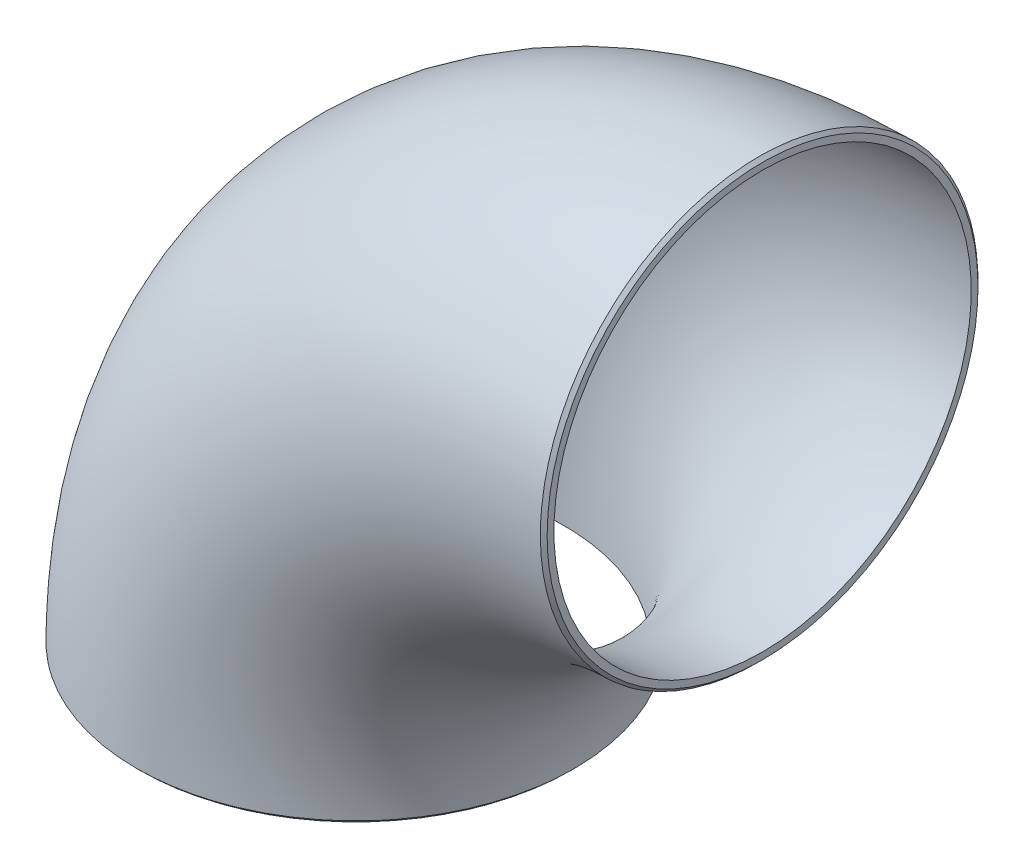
ISO-10303-21;
HEADER;
FILE_DESCRIPTION(('STEP AP214'),'2;1');
FILE_NAME('part.step','',(''),(''),'','','');
FILE_SCHEMA(('AUTOMOTIVE_DESIGN { 1 0 10303 214 1 1 1 1 }'));
ENDSEC;
DATA;
#1=APPLICATION_CONTEXT('core data for automotive mechanical design processes');
#2=APPLICATION_PROTOCOL_DEFINITION('international standard','automotive_design',2000,#1);
#3=PRODUCT_CONTEXT('',#1,'mechanical');
#4=PRODUCT('Part','Part','',(#3));
#5=PRODUCT_RELATED_PRODUCT_CATEGORY('part','',(#4));
#6=PRODUCT_DEFINITION_FORMATION('','',#4);
#7=PRODUCT_DEFINITION_CONTEXT('part definition',#1,'design');
#8=PRODUCT_DEFINITION('design','',#6,#7);
#9=PRODUCT_DEFINITION_SHAPE('','',#8);
#10=(LENGTH_UNIT() NAMED_UNIT(*) SI_UNIT(.MILLI.,.METRE.));
#11=(NAMED_UNIT(*) PLANE_ANGLE_UNIT() SI_UNIT($,.RADIAN.));
#12=(NAMED_UNIT(*) SI_UNIT($,.STERADIAN.) SOLID_ANGLE_UNIT());
#13=UNCERTAINTY_MEASURE_WITH_UNIT(LENGTH_MEASURE(1.E-05),#10,'distance_accuracy_value','');
#14=(GEOMETRIC_REPRESENTATION_CONTEXT(3) GLOBAL_UNCERTAINTY_ASSIGNED_CONTEXT((#13)) GLOBAL_UNIT_ASSIGNED_CONTEXT((#10,
#11,#12)) REPRESENTATION_CONTEXT('',''));
#15=CARTESIAN_POINT('',(0.,0.,0.));
#16=DIRECTION('',(0.,0.,1.));
#17=DIRECTION('',(1.,0.,0.));
#18=AXIS2_PLACEMENT_3D('',#15,#16,#17);
#19=CARTESIAN_POINT('',(0.,0.,0.));
#20=DIRECTION('',(0.,0.,1.));
#21=DIRECTION('',(1.,0.,0.));
#22=AXIS2_PLACEMENT_3D('',#19,#20,#21);
#23=TOROIDAL_SURFACE('',#22,254.,136.525);
#24=CARTESIAN_POINT('',(-2.1166678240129,254.000138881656,136.524999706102));
#25=CARTESIAN_POINT('',(-2.11609273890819,249.547778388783,136.525949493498));
#26=CARTESIAN_POINT('',(-2.1154859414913,245.080932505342,136.308511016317));
#27=CARTESIAN_POINT('',(-2.11419612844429,236.107142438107,135.423746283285));
#28=CARTESIAN_POINT('',(-2.11352242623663,231.666197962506,134.762439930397));
#29=CARTESIAN_POINT('',(-2.11141465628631,218.556552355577,132.144908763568));
#30=CARTESIAN_POINT('',(-2.10988837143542,210.046686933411,129.56830141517));
#31=CARTESIAN_POINT('',(-2.10736642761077,197.62482416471,124.428690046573));
#32=CARTESIAN_POINT('',(-2.10648358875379,193.532476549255,122.492074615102));
#33=CARTESIAN_POINT('',(-2.10467262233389,185.640592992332,118.269111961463));
#34=CARTESIAN_POINT('',(-2.10373895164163,181.812253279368,115.972931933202));
#35=CARTESIAN_POINT('',(-2.10086627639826,170.733032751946,108.564843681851));
#36=CARTESIAN_POINT('',(-2.09883814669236,163.818490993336,102.90833866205));
#37=CARTESIAN_POINT('',(-2.09463089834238,151.064425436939,90.1535121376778));
#38=CARTESIAN_POINT('',(-2.09251712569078,145.421118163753,83.2546688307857));
#39=CARTESIAN_POINT('',(-2.08946589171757,138.010796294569,72.1753367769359));
#40=CARTESIAN_POINT('',(-2.08846704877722,135.713537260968,68.3460804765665));
#41=CARTESIAN_POINT('',(-2.08654579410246,131.482124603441,60.4377705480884));
#42=CARTESIAN_POINT('',(-2.0856226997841,129.547355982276,56.3479628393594));
#43=CARTESIAN_POINT('',(-2.08308442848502,124.417905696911,43.9488347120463));
#44=CARTESIAN_POINT('',(-2.08168160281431,121.837723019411,35.4376264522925));
#45=CARTESIAN_POINT('',(-2.08021823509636,119.217472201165,22.3132742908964));
#46=CARTESIAN_POINT('',(-2.079838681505,118.554785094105,17.8582034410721));
#47=CARTESIAN_POINT('',(-2.07933004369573,117.67252864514,8.89638973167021));
#48=CARTESIAN_POINT('',(-2.07920328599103,117.456168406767,4.43865605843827));
#49=CARTESIAN_POINT('',(-2.07920379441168,117.457029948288,-4.46530008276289));
#50=CARTESIAN_POINT('',(-2.07933131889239,117.674739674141,-8.90583106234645));
#51=CARTESIAN_POINT('',(-2.07983260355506,118.544243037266,-17.7640238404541));
#52=CARTESIAN_POINT('',(-2.08020588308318,119.195352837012,-22.1772948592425));
#53=CARTESIAN_POINT('',(-2.08118384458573,120.946448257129,-30.9978956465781));
#54=CARTESIAN_POINT('',(-2.08178692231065,122.044704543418,-35.3775003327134));
#55=CARTESIAN_POINT('',(-2.0831615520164,124.637734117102,-43.9181996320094));
#56=CARTESIAN_POINT('',(-2.08393635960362,126.138658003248,-48.1115206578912));
#57=CARTESIAN_POINT('',(-2.08561862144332,129.539983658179,-56.3269264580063));
#58=CARTESIAN_POINT('',(-2.08652725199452,131.443248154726,-60.3555427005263));
#59=CARTESIAN_POINT('',(-2.08843802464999,135.647698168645,-68.2323651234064));
#60=CARTESIAN_POINT('',(-2.08944889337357,137.970479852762,-72.1120771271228));
#61=CARTESIAN_POINT('',(-2.09150498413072,142.962043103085,-79.5810023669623));
#62=CARTESIAN_POINT('',(-2.0925467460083,145.620564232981,-83.1626484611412));
#63=CARTESIAN_POINT('',(-2.09463522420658,151.265711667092,-90.0417502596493));
#64=CARTESIAN_POINT('',(-2.09568190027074,154.252809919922,-93.338302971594));
#65=CARTESIAN_POINT('',(-2.09775835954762,160.542870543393,-99.6362674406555));
#66=CARTESIAN_POINT('',(-2.09878927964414,163.850867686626,-102.639739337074));
#67=CARTESIAN_POINT('',(-2.1008290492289,170.81482690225,-108.359442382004));
#68=CARTESIAN_POINT('',(-2.10182494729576,174.427480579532,-111.038418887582));
#69=CARTESIAN_POINT('',(-2.10470700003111,185.551629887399,-118.466649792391));
#70=CARTESIAN_POINT('',(-2.10650424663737,193.391152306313,-122.664694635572));
#71=CARTESIAN_POINT('',(-2.10902614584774,205.793411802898,-127.814517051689));
#72=CARTESIAN_POINT('',(-2.10984099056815,210.055008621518,-129.340801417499));
#73=CARTESIAN_POINT('',(-2.11138734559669,218.629469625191,-131.9418938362));
#74=CARTESIAN_POINT('',(-2.11212326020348,222.960553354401,-133.027254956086));
#75=CARTESIAN_POINT('',(-2.11422337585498,236.032473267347,-135.628158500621));
#76=CARTESIAN_POINT('',(-2.11549284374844,244.909499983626,-136.520857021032));
#77=CARTESIAN_POINT('',(-2.11782436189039,262.948058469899,-136.52911445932));
#78=CARTESIAN_POINT('',(-2.11885613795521,271.862990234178,-135.650404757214));
#79=CARTESIAN_POINT('',(-2.12073299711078,289.554994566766,-132.120226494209));
#80=CARTESIAN_POINT('',(-2.12155414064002,298.11076090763,-129.503991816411));
#81=CARTESIAN_POINT('',(-2.12265364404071,310.421504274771,-124.397594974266));
#82=CARTESIAN_POINT('',(-2.12299919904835,314.454613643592,-122.487887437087));
#83=CARTESIAN_POINT('',(-2.12365144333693,322.337491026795,-118.271844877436));
#84=CARTESIAN_POINT('',(-2.12396086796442,326.223892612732,-115.93959447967));
#85=CARTESIAN_POINT('',(-2.12453500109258,333.670021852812,-110.953301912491));
#86=CARTESIAN_POINT('',(-2.12480149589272,337.249522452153,-108.292469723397));
#87=CARTESIAN_POINT('',(-2.12529889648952,344.121400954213,-102.644082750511));
#88=CARTESIAN_POINT('',(-2.12552997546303,347.41673581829,-99.6524554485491));
#89=CARTESIAN_POINT('',(-2.12617615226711,356.861527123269,-90.207239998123));
#90=CARTESIAN_POINT('',(-2.12654809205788,362.636144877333,-83.1625257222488));
#91=CARTESIAN_POINT('',(-2.12700952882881,370.045754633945,-72.0450619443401));
#92=CARTESIAN_POINT('',(-2.12714892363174,372.332293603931,-68.226721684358));
#93=CARTESIAN_POINT('',(-2.12740050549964,376.521801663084,-60.3803749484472));
#94=CARTESIAN_POINT('',(-2.1275129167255,378.428219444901,-56.3483079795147));
#95=CARTESIAN_POINT('',(-2.12771260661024,381.854726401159,-48.0720408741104));
#96=CARTESIAN_POINT('',(-2.12780012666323,383.379360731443,-43.802575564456));
#97=CARTESIAN_POINT('',(-2.12794743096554,385.967092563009,-35.2428628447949));
#98=CARTESIAN_POINT('',(-2.12800826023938,387.048216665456,-30.9127815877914));
#99=CARTESIAN_POINT('',(-2.12815330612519,389.638692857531,-17.83935254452));
#100=CARTESIAN_POINT('',(-2.12820193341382,390.524551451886,-8.93266307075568));
#101=CARTESIAN_POINT('',(-2.12820148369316,390.516491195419,4.58544657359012));
#102=CARTESIAN_POINT('',(-2.1281890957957,390.291892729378,9.04695546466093));
#103=CARTESIAN_POINT('',(-2.12814034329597,389.412500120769,17.9106463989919));
#104=CARTESIAN_POINT('',(-2.12810398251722,388.757723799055,22.3082382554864));
#105=CARTESIAN_POINT('',(-2.12800663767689,387.019302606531,31.0351204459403));
#106=CARTESIAN_POINT('',(-2.127945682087,385.936090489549,35.3619772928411));
#107=CARTESIAN_POINT('',(-2.1277971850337,383.327974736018,43.9553568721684));
#108=CARTESIAN_POINT('',(-2.12770962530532,381.80306996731,48.210189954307));
#109=CARTESIAN_POINT('',(-2.12740983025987,376.660362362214,60.5911438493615));
#110=CARTESIAN_POINT('',(-2.12716022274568,372.463511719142,68.4330030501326));
#111=CARTESIAN_POINT('',(-2.12669680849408,365.025243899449,79.5698362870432));
#112=CARTESIAN_POINT('',(-2.1265262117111,362.33721140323,83.1928825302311));
#113=CARTESIAN_POINT('',(-2.12615449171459,356.626360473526,90.1431120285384));
#114=CARTESIAN_POINT('',(-2.12595492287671,353.626937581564,93.4456158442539));
#115=CARTESIAN_POINT('',(-2.12552391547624,347.329180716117,99.7363273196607));
#116=CARTESIAN_POINT('',(-2.12529270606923,344.03404334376,102.720894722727));
#117=CARTESIAN_POINT('',(-2.12479423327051,337.151067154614,108.368251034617));
#118=CARTESIAN_POINT('',(-2.12452755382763,333.570567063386,111.026023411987));
#119=CARTESIAN_POINT('',(-2.12394945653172,326.078871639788,116.030358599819));
#120=CARTESIAN_POINT('',(-2.12364148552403,322.214469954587,118.342180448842));
#121=CARTESIAN_POINT('',(-2.12298969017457,314.342431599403,122.543234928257));
#122=CARTESIAN_POINT('',(-2.1226443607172,310.315359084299,124.444882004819));
#123=CARTESIAN_POINT('',(-2.12191048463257,302.102866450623,127.844762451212));
#124=CARTESIAN_POINT('',(-2.12152070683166,297.90441209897,129.346944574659));
#125=CARTESIAN_POINT('',(-2.12069095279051,289.356056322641,131.941500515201));
#126=CARTESIAN_POINT('',(-2.12024642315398,284.963562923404,133.041629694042));
#127=CARTESIAN_POINT('',(-2.11931174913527,276.162707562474,134.787046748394));
#128=CARTESIAN_POINT('',(-2.11882159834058,271.750266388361,135.438168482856));
#129=CARTESIAN_POINT('',(-2.11778729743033,262.895840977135,136.306919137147));
#130=CARTESIAN_POINT('',(-2.1172429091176,258.452499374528,136.524049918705));
#131=CARTESIAN_POINT('',(-2.1166678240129,254.000138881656,136.524999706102));
#132=B_SPLINE_CURVE_WITH_KNOTS('',3,(#24,#25,#26,#27,#28,#29,#30,#31,#32,#33,#34,#35,#36,#37,
#38,#39,#40,#41,#42,#43,#44,#45,#46,#47,#48,#49,#50,#51,#52,#53,#54,#55,#56,#57,#58,#59,#60,#61,
#62,#63,#64,#65,#66,#67,#68,#69,#70,#71,#72,#73,#74,#75,#76,#77,#78,#79,#80,#81,#82,#83,#84,#85,
#86,#87,#88,#89,#90,#91,#92,#93,#94,#95,#96,#97,#98,#99,#100,#101,#102,#103,#104,#105,#106,#107,
#108,#109,#110,#111,#112,#113,#114,#115,#116,#117,#118,#119,#120,#121,#122,#123,#124,#125,#126,
#127,#128,#129,#130,#131),.UNSPECIFIED.,.T.,.F.,(4,2,2,2,2,2,2,2,2,2,2,2,2,2,2,2,2,2,2,2,2,2,2,
2,2,2,2,2,2,2,2,2,2,2,2,2,2,2,2,2,2,2,2,2,2,2,2,2,2,2,2,2,2,4),(-0.826300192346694,
-0.813169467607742,-0.80003874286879,-0.773777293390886,-0.760646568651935,-0.747515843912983,
-0.721254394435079,-0.694992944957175,-0.681862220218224,-0.668731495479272,-0.642470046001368,
-0.629339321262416,-0.616208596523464,-0.603077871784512,-0.589947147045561,-0.576816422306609,
-0.563685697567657,-0.550554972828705,-0.537424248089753,-0.524293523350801,-0.51116279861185,
-0.498032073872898,-0.484901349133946,-0.458639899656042,-0.445509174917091,-0.432378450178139,
-0.406117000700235,-0.379855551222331,-0.353594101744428,-0.340463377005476,-0.327332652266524,
-0.314201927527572,-0.30107120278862,-0.274809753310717,-0.261679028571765,-0.248548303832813,
-0.235417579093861,-0.222286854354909,-0.196025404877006,-0.182894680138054,-0.169763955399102,
-0.15663323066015,-0.143502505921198,-0.117241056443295,-0.104110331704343,-0.0909796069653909,
-0.0778488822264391,-0.0647181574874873,-0.0515874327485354,-0.0384567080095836,
-0.0253259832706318,-0.0121952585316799,0.000935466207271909,0.0140661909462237),.UNSPECIFIED.);
#133=CARTESIAN_POINT('',(-2.1166678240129,254.000138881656,136.524999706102));
#134=VERTEX_POINT('',#133);
#135=EDGE_CURVE('E46',#134,#134,#132,.F.);
#136=ORIENTED_EDGE('',*,*,#135,.T.);
#137=EDGE_LOOP('',(#136));
#138=FACE_BOUND('',#137,.T.);
#139=CARTESIAN_POINT('',(-254.000138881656,2.11666782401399,136.524999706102));
#140=CARTESIAN_POINT('',(-255.346981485,2.11684186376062,136.525298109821));
#141=CARTESIAN_POINT('',(-256.693738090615,2.11701311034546,136.50515410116));
#142=CARTESIAN_POINT('',(-259.391357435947,2.11735087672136,136.424466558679));
#143=CARTESIAN_POINT('',(-260.742215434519,2.11751737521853,136.363764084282));
#144=CARTESIAN_POINT('',(-264.798357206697,2.11800985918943,136.121381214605));
#145=CARTESIAN_POINT('',(-267.500242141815,2.11832793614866,135.87942917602));
#146=CARTESIAN_POINT('',(-272.880315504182,2.11894342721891,135.237643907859));
#147=CARTESIAN_POINT('',(-275.558537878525,2.11924087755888,134.838096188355));
#148=CARTESIAN_POINT('',(-279.546998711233,2.11967148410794,134.118920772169));
#149=CARTESIAN_POINT('',(-280.868398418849,2.11981209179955,133.860017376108));
#150=CARTESIAN_POINT('',(-283.50048092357,2.12008840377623,133.304110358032));
#151=CARTESIAN_POINT('',(-284.811179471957,2.12022411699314,133.007181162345));
#152=CARTESIAN_POINT('',(-288.726879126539,2.12062419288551,132.059323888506));
#153=CARTESIAN_POINT('',(-291.318213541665,2.12088178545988,131.350833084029));
#154=CARTESIAN_POINT('',(-296.457670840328,2.12137986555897,129.780680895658));
#155=CARTESIAN_POINT('',(-299.005730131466,2.12162032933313,128.918812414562));
#156=CARTESIAN_POINT('',(-304.058572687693,2.12208581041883,127.042185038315));
#157=CARTESIAN_POINT('',(-306.563101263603,2.1223107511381,126.026737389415));
#158=CARTESIAN_POINT('',(-310.277854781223,2.12263673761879,124.389983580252));
#159=CARTESIAN_POINT('',(-311.512578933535,2.1227437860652,123.823679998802));
#160=CARTESIAN_POINT('',(-313.964302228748,2.12295394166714,122.655046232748));
#161=CARTESIAN_POINT('',(-315.181307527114,2.12305705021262,122.052728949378));
#162=CARTESIAN_POINT('',(-318.790794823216,2.12335944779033,120.19836225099));
#163=CARTESIAN_POINT('',(-321.156055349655,2.12355306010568,118.892598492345));
#164=CARTESIAN_POINT('',(-324.638413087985,2.12383230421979,116.833825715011));
#165=CARTESIAN_POINT('',(-325.786298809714,2.12392337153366,116.13221270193));
#166=CARTESIAN_POINT('',(-328.058164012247,2.12410177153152,114.696607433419));
#167=CARTESIAN_POINT('',(-329.182190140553,2.12418911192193,113.962689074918));
#168=CARTESIAN_POINT('',(-332.520967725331,2.12444603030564,111.712062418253));
#169=CARTESIAN_POINT('',(-334.702871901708,2.12461054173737,110.146214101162));
#170=CARTESIAN_POINT('',(-338.977002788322,2.12492697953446,106.883861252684));
#171=CARTESIAN_POINT('',(-341.068937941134,2.12507886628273,105.18697544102));
#172=CARTESIAN_POINT('',(-345.159667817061,2.12537081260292,101.662371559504));
#173=CARTESIAN_POINT('',(-347.157887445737,2.12551080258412,99.8339856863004));
#174=CARTESIAN_POINT('',(-351.04792201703,2.12577909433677,96.056769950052));
#175=CARTESIAN_POINT('',(-352.939423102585,2.12590736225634,94.1076169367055));
#176=CARTESIAN_POINT('',(-356.590158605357,2.12615132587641,90.1137979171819));
#177=CARTESIAN_POINT('',(-358.350216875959,2.12626710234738,88.0698852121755));
#178=CARTESIAN_POINT('',(-361.738533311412,2.1264869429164,83.8895549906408));
#179=CARTESIAN_POINT('',(-363.367304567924,2.1265910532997,81.7535532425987));
#180=CARTESIAN_POINT('',(-366.496363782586,2.12678870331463,77.3910675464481));
#181=CARTESIAN_POINT('',(-367.996714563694,2.12688224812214,75.1646286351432));
#182=CARTESIAN_POINT('',(-370.869208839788,2.1270593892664,70.616093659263));
#183=CARTESIAN_POINT('',(-372.240737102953,2.12714293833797,68.2936080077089));
#184=CARTESIAN_POINT('',(-374.19669505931,2.12726094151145,64.7471275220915));
#185=CARTESIAN_POINT('',(-374.833202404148,2.12729913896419,63.5515515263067));
#186=CARTESIAN_POINT('',(-376.071774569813,2.12737311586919,61.1387739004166));
#187=CARTESIAN_POINT('',(-376.673747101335,2.12740888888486,59.9215247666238));
#188=CARTESIAN_POINT('',(-377.841065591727,2.12747795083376,57.470369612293));
#189=CARTESIAN_POINT('',(-378.406430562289,2.12751124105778,56.2364726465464));
#190=CARTESIAN_POINT('',(-379.497689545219,2.12757522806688,53.7567834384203));
#191=CARTESIAN_POINT('',(-380.023720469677,2.12760593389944,52.5110512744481));
#192=CARTESIAN_POINT('',(-381.541562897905,2.12769421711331,48.7628627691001));
#193=CARTESIAN_POINT('',(-382.478577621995,2.12774828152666,46.2379410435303));
#194=CARTESIAN_POINT('',(-384.199331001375,2.12784694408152,41.1438057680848));
#195=CARTESIAN_POINT('',(-384.983455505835,2.12789156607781,38.5747219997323));
#196=CARTESIAN_POINT('',(-386.399222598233,2.12797171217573,33.3923969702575));
#197=CARTESIAN_POINT('',(-387.030738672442,2.12800722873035,30.7791209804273));
#198=CARTESIAN_POINT('',(-387.863335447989,2.12805390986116,26.8310459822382));
#199=CARTESIAN_POINT('',(-388.122081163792,2.1280683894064,25.5081569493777));
#200=CARTESIAN_POINT('',(-388.600746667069,2.12809513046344,22.8498886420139));
#201=CARTESIAN_POINT('',(-388.820506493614,2.12810738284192,21.514480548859));
#202=CARTESIAN_POINT('',(-389.421491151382,2.12814084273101,17.4903762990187));
#203=CARTESIAN_POINT('',(-389.742597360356,2.12815865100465,14.7924545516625));
#204=CARTESIAN_POINT('',(-390.222236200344,2.12818522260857,9.39662245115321));
#205=CARTESIAN_POINT('',(-390.381611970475,2.12819403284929,6.69878612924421));
#206=CARTESIAN_POINT('',(-390.53950825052,2.12820276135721,1.31175280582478));
#207=CARTESIAN_POINT('',(-390.538822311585,2.12820272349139,-1.37742071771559));
#208=CARTESIAN_POINT('',(-390.378803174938,2.12819387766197,-6.7477652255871));
#209=CARTESIAN_POINT('',(-390.219662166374,2.12818508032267,-9.42894195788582));
#210=CARTESIAN_POINT('',(-389.743218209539,2.12815868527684,-14.7824295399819));
#211=CARTESIAN_POINT('',(-389.425610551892,2.12814107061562,-17.4547132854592));
#212=CARTESIAN_POINT('',(-388.630497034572,2.12809680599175,-22.7923418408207));
#213=CARTESIAN_POINT('',(-388.152011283,2.12807010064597,-25.4575407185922));
#214=CARTESIAN_POINT('',(-387.035969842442,2.12800751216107,-30.7620906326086));
#215=CARTESIAN_POINT('',(-386.397979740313,2.12797160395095,-33.4013502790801));
#216=CARTESIAN_POINT('',(-384.970456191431,2.12789076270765,-38.6201444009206));
#217=CARTESIAN_POINT('',(-384.181933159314,2.12784588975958,-41.1999553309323));
#218=CARTESIAN_POINT('',(-382.456751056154,2.12774699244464,-46.2991719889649));
#219=CARTESIAN_POINT('',(-381.520637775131,2.12769300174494,-48.8187623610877));
#220=CARTESIAN_POINT('',(-379.501416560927,2.12757555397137,-53.797610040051));
#221=CARTESIAN_POINT('',(-378.418344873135,2.12751209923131,-56.256882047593));
#222=CARTESIAN_POINT('',(-376.106027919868,2.12737530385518,-61.1141875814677));
#223=CARTESIAN_POINT('',(-374.876381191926,2.12730193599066,-63.5120300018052));
#224=CARTESIAN_POINT('',(-372.267936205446,2.12714459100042,-68.2473703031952));
#225=CARTESIAN_POINT('',(-370.888142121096,2.12706054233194,-70.5843196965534));
#226=CARTESIAN_POINT('',(-367.993760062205,2.12688206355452,-75.1691368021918));
#227=CARTESIAN_POINT('',(-366.479341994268,2.12678764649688,-77.4171117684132));
#228=CARTESIAN_POINT('',(-363.329592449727,2.12658860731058,-81.8047142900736));
#229=CARTESIAN_POINT('',(-361.695102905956,2.12648405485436,-83.9449466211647));
#230=CARTESIAN_POINT('',(-358.30634450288,2.12626410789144,-88.1200635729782));
#231=CARTESIAN_POINT('',(-356.552373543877,2.12614874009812,-90.1551894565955));
#232=CARTESIAN_POINT('',(-353.833965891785,2.12596708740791,-93.1273984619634));
#233=CARTESIAN_POINT('',(-352.913210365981,2.12590509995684,-94.1047646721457));
#234=CARTESIAN_POINT('',(-351.042699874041,2.12577816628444,-96.0329012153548));
#235=CARTESIAN_POINT('',(-350.092921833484,2.12571321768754,-96.9836491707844));
#236=CARTESIAN_POINT('',(-347.194202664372,2.12551332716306,-99.8003833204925));
#237=CARTESIAN_POINT('',(-345.202937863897,2.12537381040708,-101.623130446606));
#238=CARTESIAN_POINT('',(-341.102538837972,2.12508122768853,-105.159199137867));
#239=CARTESIAN_POINT('',(-338.992713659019,2.12492807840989,-106.871719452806));
#240=CARTESIAN_POINT('',(-335.757510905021,2.12468859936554,-109.341690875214));
#241=CARTESIAN_POINT('',(-334.668811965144,2.12460725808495,-110.14757268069));
#242=CARTESIAN_POINT('',(-332.471691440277,2.12444144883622,-111.72355868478));
#243=CARTESIAN_POINT('',(-331.363354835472,2.12435699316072,-112.493781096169));
#244=CARTESIAN_POINT('',(-329.127962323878,2.12418491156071,-113.998330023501));
#245=CARTESIAN_POINT('',(-328.000981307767,2.12409729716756,-114.732767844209));
#246=CARTESIAN_POINT('',(-325.727800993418,2.12391874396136,-116.167274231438));
#247=CARTESIAN_POINT('',(-324.581633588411,2.12382781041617,-116.867393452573));
#248=CARTESIAN_POINT('',(-321.114169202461,2.12354972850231,-118.915780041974));
#249=CARTESIAN_POINT('',(-318.762465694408,2.12335718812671,-120.213048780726));
#250=CARTESIAN_POINT('',(-313.981220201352,2.12295655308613,-122.668819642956));
#251=CARTESIAN_POINT('',(-311.551519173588,2.12274842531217,-123.827011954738));
#252=CARTESIAN_POINT('',(-307.854680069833,2.1224241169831,-125.4580484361));
#253=CARTESIAN_POINT('',(-306.611161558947,2.12231376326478,-125.984959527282));
#254=CARTESIAN_POINT('',(-304.103741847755,2.1220884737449,-127.003363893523));
#255=CARTESIAN_POINT('',(-302.839777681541,2.12197352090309,-127.494701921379));
#256=CARTESIAN_POINT('',(-299.024947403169,2.12162217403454,-128.912758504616));
#257=CARTESIAN_POINT('',(-296.452657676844,2.12137942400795,-129.78285190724));
#258=CARTESIAN_POINT('',(-292.565088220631,2.12100260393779,-130.969616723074));
#259=CARTESIAN_POINT('',(-291.267289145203,2.12087517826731,-131.344773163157));
#260=CARTESIAN_POINT('',(-288.664541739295,2.12061618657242,-132.055738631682));
#261=CARTESIAN_POINT('',(-287.359620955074,2.12048463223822,-132.391647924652));
#262=CARTESIAN_POINT('',(-284.743618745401,2.12021725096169,-133.023766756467));
#263=CARTESIAN_POINT('',(-283.432560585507,2.12008143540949,-133.320072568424));
#264=CARTESIAN_POINT('',(-280.80475112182,2.11980536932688,-133.872998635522));
#265=CARTESIAN_POINT('',(-279.488015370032,2.11966512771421,-134.129693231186));
#266=CARTESIAN_POINT('',(-275.525729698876,2.1192371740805,-134.842238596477));
#267=CARTESIAN_POINT('',(-272.869514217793,2.11894237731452,-135.24021072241));
#268=CARTESIAN_POINT('',(-267.529066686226,2.11833168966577,-135.879525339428));
#269=CARTESIAN_POINT('',(-264.844769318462,2.11801572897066,-136.120318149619));
#270=CARTESIAN_POINT('',(-259.44919294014,2.11736065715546,-136.443146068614));
#271=CARTESIAN_POINT('',(-256.737851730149,2.11702140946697,-136.524143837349));
#272=CARTESIAN_POINT('',(-251.311305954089,2.11632055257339,-136.525848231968));
#273=CARTESIAN_POINT('',(-248.596101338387,2.11595891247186,-136.446328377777));
#274=CARTESIAN_POINT('',(-243.182822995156,2.11521359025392,-136.125430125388));
#275=CARTESIAN_POINT('',(-240.484722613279,2.11482997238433,-135.88450349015));
#276=CARTESIAN_POINT('',(-235.103743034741,2.11403843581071,-135.241017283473));
#277=CARTESIAN_POINT('',(-232.420893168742,2.11363048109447,-134.838212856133));
#278=CARTESIAN_POINT('',(-227.078056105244,2.11278955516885,-133.873673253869));
#279=CARTESIAN_POINT('',(-224.418129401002,2.11235653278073,-133.311603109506));
#280=CARTESIAN_POINT('',(-219.151800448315,2.1114681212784,-132.033274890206));
#281=CARTESIAN_POINT('',(-216.545178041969,2.11101287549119,-131.317924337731));
#282=CARTESIAN_POINT('',(-211.390614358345,2.11007982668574,-129.737001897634));
#283=CARTESIAN_POINT('',(-208.842463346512,2.10960213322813,-128.872113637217));
#284=CARTESIAN_POINT('',(-203.806912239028,2.10862342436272,-126.995999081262));
#285=CARTESIAN_POINT('',(-201.319392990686,2.10812246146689,-125.985092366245));
#286=CARTESIAN_POINT('',(-196.401737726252,2.10709498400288,-123.814755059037));
#287=CARTESIAN_POINT('',(-193.971776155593,2.10656840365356,-122.654928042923));
#288=CARTESIAN_POINT('',(-190.377536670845,2.1057604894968,-120.807832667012));
#289=CARTESIAN_POINT('',(-189.185981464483,2.10548771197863,-120.173104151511));
#290=CARTESIAN_POINT('',(-186.816723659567,2.10493509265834,-118.865135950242));
#291=CARTESIAN_POINT('',(-185.639115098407,2.10465522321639,-118.19172591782));
#292=CARTESIAN_POINT('',(-182.136204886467,2.1038072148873,-116.119132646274));
#293=CARTESIAN_POINT('',(-179.841414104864,2.10323080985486,-114.667892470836));
#294=CARTESIAN_POINT('',(-175.357303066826,2.1020616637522,-111.640802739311));
#295=CARTESIAN_POINT('',(-173.167397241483,2.10146905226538,-110.065818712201));
#296=CARTESIAN_POINT('',(-168.892343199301,2.10026914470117,-106.795069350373));
#297=CARTESIAN_POINT('',(-166.806842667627,2.09966190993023,-105.099764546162));
#298=CARTESIAN_POINT('',(-162.740344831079,2.09843434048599,-101.588997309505));
#299=CARTESIAN_POINT('',(-160.759319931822,2.09781400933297,-99.7735668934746));
#300=CARTESIAN_POINT('',(-157.868422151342,2.09687679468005,-96.9650455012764));
#301=CARTESIAN_POINT('',(-156.917507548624,2.09656301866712,-96.0138542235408));
#302=CARTESIAN_POINT('',(-155.041121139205,2.09593253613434,-94.0792647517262));
#303=CARTESIAN_POINT('',(-154.115766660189,2.09561582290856,-93.0957526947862));
#304=CARTESIAN_POINT('',(-151.377452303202,2.09466233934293,-90.0974787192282));
#305=CARTESIAN_POINT('',(-149.60913234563,2.09402446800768,-88.0416785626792));
#306=CARTESIAN_POINT('',(-146.197236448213,2.09275338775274,-83.8309089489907));
#307=CARTESIAN_POINT('',(-144.553591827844,2.09212017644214,-81.6759951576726));
#308=CARTESIAN_POINT('',(-142.19087815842,2.09118053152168,-78.3777845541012));
#309=CARTESIAN_POINT('',(-141.422010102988,2.09086968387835,-77.2699138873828));
#310=CARTESIAN_POINT('',(-139.920395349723,2.0902528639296,-75.0352497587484));
#311=CARTESIAN_POINT('',(-139.187538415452,2.08994687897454,-73.9085303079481));
#312=CARTESIAN_POINT('',(-137.040060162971,2.08903709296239,-70.4991438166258));
#313=CARTESIAN_POINT('',(-135.674926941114,2.08844081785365,-68.1850029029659));
#314=CARTESIAN_POINT('',(-133.083488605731,2.08727756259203,-63.4782967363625));
#315=CARTESIAN_POINT('',(-131.857284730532,2.08671060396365,-61.0856759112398));
#316=CARTESIAN_POINT('',(-129.542854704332,2.08561401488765,-56.2221346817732));
#317=CARTESIAN_POINT('',(-128.455224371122,2.08508454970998,-53.7509297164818));
#318=CARTESIAN_POINT('',(-126.932877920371,2.08432706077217,-49.9920766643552));
#319=CARTESIAN_POINT('',(-126.442365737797,2.0840800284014,-48.7267528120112));
#320=CARTESIAN_POINT('',(-125.498494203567,2.08359968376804,-46.1805419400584));
#321=CARTESIAN_POINT('',(-125.045180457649,2.08336638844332,-44.8996379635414));
#322=CARTESIAN_POINT('',(-124.178252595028,2.08291584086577,-42.3288618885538));
#323=CARTESIAN_POINT('',(-123.764520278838,2.0826985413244,-41.0390296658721));
#324=CARTESIAN_POINT('',(-122.977561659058,2.08228155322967,-38.4530832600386));
#325=CARTESIAN_POINT('',(-122.604171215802,2.0820817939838,-37.1570188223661));
#326=CARTESIAN_POINT('',(-121.54359655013,2.08150979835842,-33.2606221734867));
#327=CARTESIAN_POINT('',(-120.913454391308,2.08116350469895,-30.6444948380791));
#328=CARTESIAN_POINT('',(-119.810658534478,2.08055074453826,-25.384825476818));
#329=CARTESIAN_POINT('',(-119.337696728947,2.08028412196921,-22.7413476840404));
#330=CARTESIAN_POINT('',(-118.54669266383,2.07983506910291,-17.4236653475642));
#331=CARTESIAN_POINT('',(-118.229090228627,2.07965287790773,-14.7493952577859));
#332=CARTESIAN_POINT('',(-117.751847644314,2.07937703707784,-9.37464474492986));
#333=CARTESIAN_POINT('',(-117.592926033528,2.07928379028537,-6.67410051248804));
#334=CARTESIAN_POINT('',(-117.435325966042,2.07919129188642,-1.25781883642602));
#335=CARTESIAN_POINT('',(-117.437273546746,2.0791924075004,1.45793683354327));
#336=CARTESIAN_POINT('',(-117.602660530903,2.07928861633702,6.86681048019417));
#337=CARTESIAN_POINT('',(-117.765047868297,2.07938309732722,9.55996068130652));
#338=CARTESIAN_POINT('',(-118.247999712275,2.07966202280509,14.9217298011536));
#339=CARTESIAN_POINT('',(-118.567961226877,2.07984612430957,17.5904030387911));
#340=CARTESIAN_POINT('',(-119.364725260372,2.08029908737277,22.902796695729));
#341=CARTESIAN_POINT('',(-119.841445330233,2.08056790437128,25.5465294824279));
#342=CARTESIAN_POINT('',(-120.951499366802,2.08118451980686,30.8087997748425));
#343=CARTESIAN_POINT('',(-121.585276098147,2.08153254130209,33.4272439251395));
#344=CARTESIAN_POINT('',(-123.011211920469,2.08230102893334,38.638811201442));
#345=CARTESIAN_POINT('',(-123.804369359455,2.08272194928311,41.2316608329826));
#346=CARTESIAN_POINT('',(-125.543722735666,2.08362500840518,46.3670622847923));
#347=CARTESIAN_POINT('',(-126.489989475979,2.08410717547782,48.9095902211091));
#348=CARTESIAN_POINT('',(-128.019666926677,2.08486752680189,52.670035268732));
#349=CARTESIAN_POINT('',(-128.546346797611,2.08512640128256,53.9112978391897));
#350=CARTESIAN_POINT('',(-129.634582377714,2.08565448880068,56.3749367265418));
#351=CARTESIAN_POINT('',(-130.196052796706,2.0859236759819,57.5973507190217));
#352=CARTESIAN_POINT('',(-131.932236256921,2.08674512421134,61.234584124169));
#353=CARTESIAN_POINT('',(-133.160611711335,2.08731221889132,63.6240417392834));
#354=CARTESIAN_POINT('',(-135.757145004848,2.08847652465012,68.3270901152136));
#355=CARTESIAN_POINT('',(-137.125363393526,2.08907374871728,70.6406474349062));
#356=CARTESIAN_POINT('',(-139.278998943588,2.08998515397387,74.0504958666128));
#357=CARTESIAN_POINT('',(-140.014754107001,2.09029194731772,75.1784147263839));
#358=CARTESIAN_POINT('',(-141.522483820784,2.09091059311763,77.4161933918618));
#359=CARTESIAN_POINT('',(-142.294588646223,2.09122246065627,78.5259654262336));
#360=CARTESIAN_POINT('',(-144.666183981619,2.09216489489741,81.8287333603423));
#361=CARTESIAN_POINT('',(-146.315375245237,2.0927999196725,83.9863422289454));
#362=CARTESIAN_POINT('',(-149.733173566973,2.09407127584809,88.1922336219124));
#363=CARTESIAN_POINT('',(-151.501349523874,2.09470759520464,90.2408672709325));
#364=CARTESIAN_POINT('',(-155.145738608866,2.09597346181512,94.2177131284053));
#365=CARTESIAN_POINT('',(-157.021258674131,2.0966030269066,96.146560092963));
#366=CARTESIAN_POINT('',(-160.879623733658,2.09785235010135,99.8870511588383));
#367=CARTESIAN_POINT('',(-162.862283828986,2.09847212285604,101.698886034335));
#368=CARTESIAN_POINT('',(-166.933650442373,2.09969927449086,105.204947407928));
#369=CARTESIAN_POINT('',(-169.022495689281,2.10030663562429,106.899012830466));
#370=CARTESIAN_POINT('',(-173.3086014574,2.10150780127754,110.169801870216));
#371=CARTESIAN_POINT('',(-175.506401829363,2.10210151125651,111.745818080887));
#372=CARTESIAN_POINT('',(-180.001913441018,2.10327163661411,114.771652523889));
#373=CARTESIAN_POINT('',(-182.300037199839,2.10384796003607,116.220857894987));
#374=CARTESIAN_POINT('',(-186.964490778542,2.1049750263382,118.971304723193));
#375=CARTESIAN_POINT('',(-189.330324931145,2.10552590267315,120.273386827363));
#376=CARTESIAN_POINT('',(-194.12454615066,2.10660192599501,122.729664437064));
#377=CARTESIAN_POINT('',(-196.552615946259,2.10712717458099,123.884479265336));
#378=CARTESIAN_POINT('',(-201.4703257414,2.10815315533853,126.047798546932));
#379=CARTESIAN_POINT('',(-203.959904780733,2.10865391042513,127.05644155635));
#380=CARTESIAN_POINT('',(-209.000918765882,2.10963238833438,128.92774887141));
#381=CARTESIAN_POINT('',(-211.552502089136,2.11011004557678,129.790013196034));
#382=CARTESIAN_POINT('',(-216.719392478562,2.11104379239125,131.367064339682));
#383=CARTESIAN_POINT('',(-219.335008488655,2.11149971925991,132.080842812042));
#384=CARTESIAN_POINT('',(-223.289251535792,2.11216566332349,133.035082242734));
#385=CARTESIAN_POINT('',(-224.614020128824,2.11238489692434,133.334035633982));
#386=CARTESIAN_POINT('',(-227.267690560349,2.1128164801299,133.891116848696));
#387=CARTESIAN_POINT('',(-228.596565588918,2.11302884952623,134.149372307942));
#388=CARTESIAN_POINT('',(-232.580820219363,2.11365488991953,134.862559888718));
#389=CARTESIAN_POINT('',(-235.246882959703,2.11405968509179,135.259055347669));
#390=CARTESIAN_POINT('',(-240.589704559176,2.11484469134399,135.892262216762));
#391=CARTESIAN_POINT('',(-243.266406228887,2.115224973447,136.129455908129));
#392=CARTESIAN_POINT('',(-247.28787984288,2.11577845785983,136.366447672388));
#393=CARTESIAN_POINT('',(-248.629377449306,2.11596012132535,136.425645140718));
#394=CARTESIAN_POINT('',(-251.31393995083,2.11631802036,136.504744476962));
#395=CARTESIAN_POINT('',(-252.657005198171,2.11649425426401,136.52463440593));
#396=CARTESIAN_POINT('',(-254.000138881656,2.11666782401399,136.524999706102));
#397=B_SPLINE_CURVE_WITH_KNOTS('',3,(#139,#140,#141,#142,#143,#144,#145,#146,#147,#148,#149,
#150,#151,#152,#153,#154,#155,#156,#157,#158,#159,#160,#161,#162,#163,#164,#165,#166,#167,#168,
#169,#170,#171,#172,#173,#174,#175,#176,#177,#178,#179,#180,#181,#182,#183,#184,#185,#186,#187,
#188,#189,#190,#191,#192,#193,#194,#195,#196,#197,#198,#199,#200,#201,#202,#203,#204,#205,#206,
#207,#208,#209,#210,#211,#212,#213,#214,#215,#216,#217,#218,#219,#220,#221,#222,#223,#224,#225,
#226,#227,#228,#229,#230,#231,#232,#233,#234,#235,#236,#237,#238,#239,#240,#241,#242,#243,#244,
#245,#246,#247,#248,#249,#250,#251,#252,#253,#254,#255,#256,#257,#258,#259,#260,#261,#262,#263,
#264,#265,#266,#267,#268,#269,#270,#271,#272,#273,#274,#275,#276,#277,#278,#279,#280,#281,#282,
#283,#284,#285,#286,#287,#288,#289,#290,#291,#292,#293,#294,#295,#296,#297,#298,#299,#300,#301,
#302,#303,#304,#305,#306,#307,#308,#309,#310,#311,#312,#313,#314,#315,#316,#317,#318,#319,#320,
#321,#322,#323,#324,#325,#326,#327,#328,#329,#330,#331,#332,#333,#334,#335,#336,#337,#338,#339,
#340,#341,#342,#343,#344,#345,#346,#347,#348,#349,#350,#351,#352,#353,#354,#355,#356,#357,#358,
#359,#360,#361,#362,#363,#364,#365,#366,#367,#368,#369,#370,#371,#372,#373,#374,#375,#376,#377,
#378,#379,#380,#381,#382,#383,#384,#385,#386,#387,#388,#389,#390,#391,#392,#393,#394,#395,#396),
.UNSPECIFIED.,.F.,.F.,(4,2,2,2,2,2,2,2,2,2,2,2,2,2,2,2,2,2,2,2,2,2,2,2,2,2,2,2,2,2,2,2,2,2,2,2,
2,2,2,2,2,2,2,2,2,2,2,2,2,2,2,2,2,2,2,2,2,2,2,2,2,2,2,2,2,2,2,2,2,2,2,2,2,2,2,2,2,2,2,2,2,2,2,2,
2,2,2,2,2,2,2,2,2,2,2,2,2,2,2,2,2,2,2,2,2,2,2,2,2,2,2,2,2,2,2,2,2,2,2,2,2,2,2,2,2,2,2,2,4),(0.,
4.0402028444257,8.09633203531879,16.2294563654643,24.3479134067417,28.386951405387,
32.4182014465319,40.4723939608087,48.537545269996,56.6400018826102,60.7146659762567,
64.7878790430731,72.8874799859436,76.9229920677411,80.9497094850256,89.0015657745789,
97.0778037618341,105.198429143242,113.341810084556,121.428904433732,129.482683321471,
137.532499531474,145.618989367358,149.68186160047,153.755128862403,157.826263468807,
161.882495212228,169.956907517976,178.010670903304,186.071088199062,190.114445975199,
194.174028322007,202.319683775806,210.422652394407,218.485449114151,226.538478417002,
234.607052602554,242.72568981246,250.866683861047,258.954841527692,267.013761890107,
275.070698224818,283.150232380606,291.287059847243,299.413759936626,307.488098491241,
315.542994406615,319.570813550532,323.601922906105,331.695498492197,339.842470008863,
343.905511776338,347.953945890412,351.988857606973,356.017622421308,364.06993661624,
372.139868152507,376.190971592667,380.258804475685,388.39942721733,392.451785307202,
396.493553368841,400.525310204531,404.549405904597,412.601950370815,420.682507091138,
428.815349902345,436.959675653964,445.081300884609,453.215257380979,461.366449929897,
469.470653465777,477.538742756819,485.589434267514,493.662019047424,497.711710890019,
501.780855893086,509.921151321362,518.008861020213,526.067130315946,534.12326046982,
538.157728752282,542.208376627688,550.338457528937,558.46402674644,562.509072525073,
566.540846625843,574.596127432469,582.657240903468,590.751921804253,594.822642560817,
598.898281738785,602.961343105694,607.007195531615,615.074907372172,623.126710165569,
631.201177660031,639.312044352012,647.454476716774,655.543867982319,663.60254118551,
671.656982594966,679.73439419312,687.864074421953,695.997524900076,700.042150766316,
704.077225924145,712.132350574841,720.190977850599,724.230492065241,728.285788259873,
736.427688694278,744.541531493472,752.607874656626,760.660716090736,768.724363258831,
776.832999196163,784.978877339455,793.075565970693,801.136995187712,809.190732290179,
817.266133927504,825.394702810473,829.468427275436,833.529110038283,841.610260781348,
849.666834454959,853.694739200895,857.723867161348),.UNSPECIFIED.);
#398=CARTESIAN_POINT('',(-254.000138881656,2.11666782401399,136.524999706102));
#399=VERTEX_POINT('',#398);
#400=EDGE_CURVE('E51',#399,#399,#397,.F.);
#401=ORIENTED_EDGE('',*,*,#400,.T.);
#402=EDGE_LOOP('',(#401));
#403=FACE_BOUND('',#402,.T.);
#404=ADVANCED_FACE('F34',(#138,#403),#23,.T.);
#405=CARTESIAN_POINT('',(8.30436930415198E-13,254.,0.));
#406=DIRECTION('',(1.,0.,0.));
#407=DIRECTION('',(0.,0.,1.));
#408=AXIS2_PLACEMENT_3D('',#405,#406,#407);
#409=PLANE('',#408);
#410=CARTESIAN_POINT('',(9.90351231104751E-13,254.,134.408333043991));
#411=CARTESIAN_POINT('',(9.99018385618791E-13,256.644372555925,134.408032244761));
#412=CARTESIAN_POINT('',(1.00770713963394E-12,259.288676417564,134.329755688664));
#413=CARTESIAN_POINT('',(1.02503683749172E-12,264.567814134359,134.017565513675));
#414=CARTESIAN_POINT('',(1.03367778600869E-12,267.202648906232,133.783667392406));
#415=CARTESIAN_POINT('',(1.0508495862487E-12,272.462303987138,133.159568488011));
#416=CARTESIAN_POINT('',(1.05938000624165E-12,275.087066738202,132.768878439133));
#417=CARTESIAN_POINT('',(1.07226082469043E-12,279.009571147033,132.06620276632));
#418=CARTESIAN_POINT('',(1.07657945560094E-12,280.317861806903,131.811759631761));
#419=CARTESIAN_POINT('',(1.08515717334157E-12,282.930380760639,131.262940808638));
#420=CARTESIAN_POINT('',(1.08941602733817E-12,284.234582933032,130.968440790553));
#421=CARTESIAN_POINT('',(1.10216654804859E-12,288.127342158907,130.028468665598));
#422=CARTESIAN_POINT('',(1.1106522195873E-12,290.702246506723,129.325412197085));
#423=CARTESIAN_POINT('',(1.12724084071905E-12,295.788706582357,127.772125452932));
#424=CARTESIAN_POINT('',(1.13534592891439E-12,298.300566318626,126.92288692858));
#425=CARTESIAN_POINT('',(1.15157308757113E-12,303.263112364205,125.079899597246));
#426=CARTESIAN_POINT('',(1.1596950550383E-12,305.713943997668,124.086542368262));
#427=CARTESIAN_POINT('',(1.17563234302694E-12,310.555120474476,121.956038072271));
#428=CARTESIAN_POINT('',(1.18344735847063E-12,312.945404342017,120.818752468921));
#429=CARTESIAN_POINT('',(1.19893228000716E-12,317.665018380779,118.399785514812));
#430=CARTESIAN_POINT('',(1.20660139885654E-12,319.994035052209,117.117492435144));
#431=CARTESIAN_POINT('',(1.22173906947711E-12,324.585820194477,114.408907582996));
#432=CARTESIAN_POINT('',(1.2292061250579E-12,326.848101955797,112.981790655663));
#433=CARTESIAN_POINT('',(1.24370823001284E-12,331.273382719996,110.002161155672));
#434=CARTESIAN_POINT('',(1.25074511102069E-12,333.436791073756,108.450256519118));
#435=CARTESIAN_POINT('',(1.26460268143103E-12,337.655818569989,105.229522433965));
#436=CARTESIAN_POINT('',(1.27142435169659E-12,339.711967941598,103.561387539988));
#437=CARTESIAN_POINT('',(1.28449634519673E-12,343.71959255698,100.108998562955));
#438=CARTESIAN_POINT('',(1.29074741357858E-12,345.671202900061,98.3249012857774));
#439=CARTESIAN_POINT('',(1.3030994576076E-12,349.469122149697,94.6416834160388));
#440=CARTESIAN_POINT('',(1.30920016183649E-12,351.315247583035,92.7423735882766));
#441=CARTESIAN_POINT('',(1.32101948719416E-12,354.902503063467,88.8264083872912));
#442=CARTESIAN_POINT('',(1.32673563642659E-12,356.642947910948,86.8091256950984));
#443=CARTESIAN_POINT('',(1.33772092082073E-12,360.007011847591,82.6677278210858));
#444=CARTESIAN_POINT('',(1.34298846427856E-12,361.630212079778,80.5432716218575));
#445=CARTESIAN_POINT('',(1.35052737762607E-12,363.964358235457,77.2913066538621));
#446=CARTESIAN_POINT('',(1.35297552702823E-12,364.724247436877,76.1986311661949));
#447=CARTESIAN_POINT('',(1.3577782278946E-12,366.208118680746,73.9953246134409));
#448=CARTESIAN_POINT('',(1.36013310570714E-12,366.932228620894,72.884779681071));
#449=CARTESIAN_POINT('',(1.36704815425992E-12,369.051777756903,69.5274346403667));
#450=CARTESIAN_POINT('',(1.37147125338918E-12,370.398318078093,67.2495063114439));
#451=CARTESIAN_POINT('',(1.37990225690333E-12,372.953677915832,62.6188694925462));
#452=CARTESIAN_POINT('',(1.38391033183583E-12,374.162554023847,60.2661922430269));
#453=CARTESIAN_POINT('',(1.38958462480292E-12,375.871134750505,56.6849496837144));
#454=CARTESIAN_POINT('',(1.391421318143E-12,376.423675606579,55.48134281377));
#455=CARTESIAN_POINT('',(1.39497901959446E-12,377.494590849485,53.0556000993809));
#456=CARTESIAN_POINT('',(1.39669974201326E-12,378.012880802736,51.8334269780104));
#457=CARTESIAN_POINT('',(1.40170402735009E-12,379.518152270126,48.1308489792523));
#458=CARTESIAN_POINT('',(1.40480900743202E-12,380.449277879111,45.627471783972));
#459=CARTESIAN_POINT('',(1.41044785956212E-12,382.160649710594,40.5713583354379));
#460=CARTESIAN_POINT('',(1.412982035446E-12,382.940976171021,38.0186491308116));
#461=CARTESIAN_POINT('',(1.41759604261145E-12,384.343772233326,32.8877490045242));
#462=CARTESIAN_POINT('',(1.41967868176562E-12,384.967221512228,30.3098262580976));
#463=CARTESIAN_POINT('',(1.42318711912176E-12,386.059083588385,25.128988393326));
#464=CARTESIAN_POINT('',(1.42461475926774E-12,386.527930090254,22.5261646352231));
#465=CARTESIAN_POINT('',(1.42696355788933E-12,387.311397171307,17.2959599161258));
#466=CARTESIAN_POINT('',(1.42788444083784E-12,387.625933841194,14.6685663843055));
#467=CARTESIAN_POINT('',(1.42941262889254E-12,388.100485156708,9.38970506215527));
#468=CARTESIAN_POINT('',(1.43001871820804E-12,388.259902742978,6.73818359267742));
#469=CARTESIAN_POINT('',(1.43058847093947E-12,388.421826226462,1.41298265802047));
#470=CARTESIAN_POINT('',(1.43054790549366E-12,388.423298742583,-1.2607282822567));
#471=CARTESIAN_POINT('',(1.42998593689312E-12,388.267278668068,-6.59301281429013));
#472=CARTESIAN_POINT('',(1.42946641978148E-12,388.110409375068,-9.25160465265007));
#473=CARTESIAN_POINT('',(1.42797097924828E-12,387.639762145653,-14.5427993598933));
#474=CARTESIAN_POINT('',(1.42699712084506E-12,387.326693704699,-17.1754653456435));
#475=CARTESIAN_POINT('',(1.42454443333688E-12,386.547206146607,-22.4104600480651));
#476=CARTESIAN_POINT('',(1.42306701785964E-12,386.081216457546,-25.0128528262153));
#477=CARTESIAN_POINT('',(1.41962095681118E-12,384.994803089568,-30.1908287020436));
#478=CARTESIAN_POINT('',(1.4176513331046E-12,384.374071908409,-32.76634764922));
#479=CARTESIAN_POINT('',(1.41417164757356E-12,383.32940345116,-36.6022728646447));
#480=CARTESIAN_POINT('',(1.4129219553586E-12,382.96161899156,-37.8782361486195));
#481=CARTESIAN_POINT('',(1.41031499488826E-12,382.186497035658,-40.4240698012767));
#482=CARTESIAN_POINT('',(1.40895729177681E-12,381.778997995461,-41.6938911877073));
#483=CARTESIAN_POINT('',(1.40616266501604E-12,380.925158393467,-44.2247516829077));
#484=CARTESIAN_POINT('',(1.40472551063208E-12,380.478702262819,-45.485751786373));
#485=CARTESIAN_POINT('',(1.40167212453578E-12,379.549141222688,-47.9923525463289));
#486=CARTESIAN_POINT('',(1.40005611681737E-12,379.06608238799,-49.2379703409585));
#487=CARTESIAN_POINT('',(1.39507813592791E-12,377.566902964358,-52.938245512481));
#488=CARTESIAN_POINT('',(1.39156931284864E-12,376.495858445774,-55.3709193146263));
#489=CARTESIAN_POINT('',(1.38418445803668E-12,374.216754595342,-60.1586661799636));
#490=CARTESIAN_POINT('',(1.38031000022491E-12,373.009278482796,-62.5140178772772));
#491=CARTESIAN_POINT('',(1.37194563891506E-12,370.457446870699,-67.1474094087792));
#492=CARTESIAN_POINT('',(1.36745617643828E-12,369.11318963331,-69.4255031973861));
#493=CARTESIAN_POINT('',(1.36054432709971E-12,366.998562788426,-72.7817816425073));
#494=CARTESIAN_POINT('',(1.35820950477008E-12,366.276911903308,-73.8909596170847));
#495=CARTESIAN_POINT('',(1.3534269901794E-12,364.798264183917,-76.0908277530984));
#496=CARTESIAN_POINT('',(1.35097895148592E-12,364.041158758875,-77.1814449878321));
#497=CARTESIAN_POINT('',(1.34343640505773E-12,361.714617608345,-80.42825682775));
#498=CARTESIAN_POINT('',(1.3381633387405E-12,360.096156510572,-82.5495659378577));
#499=CARTESIAN_POINT('',(1.32718533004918E-12,356.736585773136,-86.6946078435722));
#500=CARTESIAN_POINT('',(1.32148015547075E-12,354.995410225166,-88.7182872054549));
#501=CARTESIAN_POINT('',(1.31262306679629E-12,352.299158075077,-91.6696756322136));
#502=CARTESIAN_POINT('',(1.30962643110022E-12,351.388027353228,-92.6377962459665));
#503=CARTESIAN_POINT('',(1.30354460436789E-12,349.54049335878,-94.5420955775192));
#504=CARTESIAN_POINT('',(1.30045981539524E-12,348.604205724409,-95.4783865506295));
#505=CARTESIAN_POINT('',(1.29104549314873E-12,345.75775537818,-98.2429275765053));
#506=CARTESIAN_POINT('',(1.28454684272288E-12,343.807189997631,-100.029918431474));
#507=CARTESIAN_POINT('',(1.27134064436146E-12,339.803217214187,-103.485664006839));
#508=CARTESIAN_POINT('',(1.26463303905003E-12,337.749781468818,-105.154385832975));
#509=CARTESIAN_POINT('',(1.25097293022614E-12,333.540438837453,-108.373824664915));
#510=CARTESIAN_POINT('',(1.24401961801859E-12,331.384183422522,-109.924085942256));
#511=CARTESIAN_POINT('',(1.22966524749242E-12,326.96901673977,-112.903589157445));
#512=CARTESIAN_POINT('',(1.22226157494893E-12,324.709529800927,-114.331979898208));
#513=CARTESIAN_POINT('',(1.21090368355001E-12,321.260568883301,-116.37186599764));
#514=CARTESIAN_POINT('',(1.20707621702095E-12,320.101128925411,-117.034624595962));
#515=CARTESIAN_POINT('',(1.19937762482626E-12,317.768439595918,-118.321884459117));
#516=CARTESIAN_POINT('',(1.19550679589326E-12,316.59528290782,-118.946553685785));
#517=CARTESIAN_POINT('',(1.18387215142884E-12,313.056517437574,-120.764367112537));
#518=CARTESIAN_POINT('',(1.17606098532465E-12,310.664060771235,-121.905776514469));
#519=CARTESIAN_POINT('',(1.16011341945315E-12,305.822286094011,-124.041605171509));
#520=CARTESIAN_POINT('',(1.15197795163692E-12,303.373138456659,-125.036411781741));
#521=CARTESIAN_POINT('',(1.13565633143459E-12,298.415237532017,-126.882571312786));
#522=CARTESIAN_POINT('',(1.12747010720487E-12,295.906365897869,-127.733606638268));
#523=CARTESIAN_POINT('',(1.11092662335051E-12,290.831290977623,-129.289110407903));
#524=CARTESIAN_POINT('',(1.10256876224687E-12,288.26488136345,-129.992905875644));
#525=CARTESIAN_POINT('',(1.08560286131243E-12,283.07987734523,-131.25044654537));
#526=CARTESIAN_POINT('',(1.07699365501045E-12,280.461067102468,-131.803301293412));
#527=CARTESIAN_POINT('',(1.05971597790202E-12,275.200840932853,-132.75186884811));
#528=CARTESIAN_POINT('',(1.05104767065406E-12,272.559484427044,-133.147911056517));
#529=CARTESIAN_POINT('',(1.03367562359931E-12,267.261753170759,-133.780383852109));
#530=CARTESIAN_POINT('',(1.0249719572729E-12,264.605407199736,-134.017055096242));
#531=CARTESIAN_POINT('',(1.00748588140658E-12,259.275962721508,-134.33192808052));
#532=CARTESIAN_POINT('',(9.98703320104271E-13,256.602838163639,-134.409686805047));
#533=CARTESIAN_POINT('',(9.81142966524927E-13,251.260481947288,-134.406953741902));
#534=CARTESIAN_POINT('',(9.72365185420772E-13,248.591250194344,-134.326688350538));
#535=CARTESIAN_POINT('',(9.54934353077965E-13,243.279528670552,-134.007832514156));
#536=CARTESIAN_POINT('',(9.46280862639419E-13,240.636977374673,-133.770264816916));
#537=CARTESIAN_POINT('',(9.29094579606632E-13,235.379585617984,-133.139856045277));
#538=CARTESIAN_POINT('',(9.20561473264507E-13,232.764680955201,-132.747554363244));
#539=CARTESIAN_POINT('',(9.0787311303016E-13,228.864011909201,-132.045324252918));
#540=CARTESIAN_POINT('',(9.03663291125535E-13,227.567738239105,-131.792365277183));
#541=CARTESIAN_POINT('',(8.95246719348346E-13,224.980759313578,-131.24752281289));
#542=CARTESIAN_POINT('',(8.91039990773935E-13,223.690069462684,-130.95556575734));
#543=CARTESIAN_POINT('',(8.82628329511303E-13,221.114697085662,-130.332752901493));
#544=CARTESIAN_POINT('',(8.78423427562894E-13,219.830037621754,-130.001801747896));
#545=CARTESIAN_POINT('',(8.70008060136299E-13,217.267680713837,-129.30135190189));
#546=CARTESIAN_POINT('',(8.65797609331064E-13,215.990010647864,-128.931753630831));
#547=CARTESIAN_POINT('',(8.53177907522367E-13,212.162833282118,-127.762642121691));
#548=CARTESIAN_POINT('',(8.44817760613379E-13,209.63054435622,-126.905560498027));
#549=CARTESIAN_POINT('',(8.32517231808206E-13,205.875121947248,-125.508803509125));
#550=CARTESIAN_POINT('',(8.28458303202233E-13,204.630886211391,-125.024873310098));
#551=CARTESIAN_POINT('',(8.2043524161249E-13,202.162623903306,-124.021852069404));
#552=CARTESIAN_POINT('',(8.16470786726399E-13,200.938535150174,-123.502914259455));
#553=CARTESIAN_POINT('',(8.04628730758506E-13,197.299407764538,-121.896567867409));
#554=CARTESIAN_POINT('',(7.96770886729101E-13,194.907628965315,-120.755941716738));
#555=CARTESIAN_POINT('',(7.81248662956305E-13,190.200963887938,-118.337466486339));
#556=CARTESIAN_POINT('',(7.73583902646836E-13,187.885922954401,-117.059918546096));
#557=CARTESIAN_POINT('',(7.62265488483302E-13,184.472514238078,-115.042710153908));
#558=CARTESIAN_POINT('',(7.58521260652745E-13,183.344206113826,-114.353247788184));
#559=CARTESIAN_POINT('',(7.51093574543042E-13,181.106442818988,-112.940585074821));
#560=CARTESIAN_POINT('',(7.47410218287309E-13,179.997019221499,-112.217334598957));
#561=CARTESIAN_POINT('',(7.40121460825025E-13,177.796442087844,-110.735703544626));
#562=CARTESIAN_POINT('',(7.36516363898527E-13,176.705362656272,-109.977212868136));
#563=CARTESIAN_POINT('',(7.29389036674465E-13,174.542460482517,-108.425249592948));
#564=CARTESIAN_POINT('',(7.25867151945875E-13,173.470721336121,-107.631660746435));
#565=CARTESIAN_POINT('',(7.15451342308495E-13,170.286049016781,-105.199478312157));
#566=CARTESIAN_POINT('',(7.08725802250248E-13,168.209227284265,-103.513218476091));
#567=CARTESIAN_POINT('',(6.95479572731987E-13,164.173018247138,-100.03145050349));
#568=CARTESIAN_POINT('',(6.88957827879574E-13,162.212949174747,-98.236732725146));
#569=CARTESIAN_POINT('',(6.79446359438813E-13,159.359643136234,-95.4633377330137));
#570=CARTESIAN_POINT('',(6.76326859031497E-13,158.424739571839,-94.5272162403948));
#571=CARTESIAN_POINT('',(6.70206416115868E-13,156.583518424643,-92.6287432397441));
#572=CARTESIAN_POINT('',(6.67205380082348E-13,155.6771784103,-91.6664134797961));
#573=CARTESIAN_POINT('',(6.58469883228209E-13,153.001315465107,-88.7399205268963));
#574=CARTESIAN_POINT('',(6.53002515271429E-13,151.274799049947,-86.736107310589));
#575=CARTESIAN_POINT('',(6.4202859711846E-13,147.93908687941,-82.6252421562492));
#576=CARTESIAN_POINT('',(6.36521984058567E-13,146.330185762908,-80.5179516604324));
#577=CARTESIAN_POINT('',(6.26108159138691E-13,143.229747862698,-76.1978686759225));
#578=CARTESIAN_POINT('',(6.21205078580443E-13,141.739042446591,-73.9844791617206));
#579=CARTESIAN_POINT('',(6.11803681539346E-13,138.89010054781,-69.4703616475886));
#580=CARTESIAN_POINT('',(6.07305852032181E-13,137.532023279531,-67.1695331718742));
#581=CARTESIAN_POINT('',(5.98930993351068E-13,134.96465851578,-62.5074014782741));
#582=CARTESIAN_POINT('',(5.95049818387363E-13,133.75439125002,-60.1466377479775));
#583=CARTESIAN_POINT('',(5.87631649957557E-13,131.478545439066,-55.364435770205));
#584=CARTESIAN_POINT('',(5.84093727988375E-13,130.412573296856,-52.943184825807));
#585=CARTESIAN_POINT('',(5.77480598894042E-13,128.425264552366,-48.041287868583));
#586=CARTESIAN_POINT('',(5.74405514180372E-13,127.50396621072,-45.5606263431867));
#587=CARTESIAN_POINT('',(5.68637683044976E-13,125.806141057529,-40.5401855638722));
#588=CARTESIAN_POINT('',(5.65946368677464E-13,125.030153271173,-38.0002240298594));
#589=CARTESIAN_POINT('',(5.61287936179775E-13,123.625408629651,-32.8620635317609));
#590=CARTESIAN_POINT('',(5.59325662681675E-13,122.997646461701,-30.2635925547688));
#591=CARTESIAN_POINT('',(5.55797773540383E-13,121.899637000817,-25.0411709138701));
#592=CARTESIAN_POINT('',(5.54231064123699E-13,121.428954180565,-22.417311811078));
#593=CARTESIAN_POINT('',(5.51482574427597E-13,120.646935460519,-17.1624469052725));
#594=CARTESIAN_POINT('',(5.50298486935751E-13,120.33463773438,-14.5315842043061));
#595=CARTESIAN_POINT('',(5.4877521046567E-13,119.866370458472,-9.26107095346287));
#596=CARTESIAN_POINT('',(5.48434406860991E-13,119.710102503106,-6.62144690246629));
#597=CARTESIAN_POINT('',(5.48106755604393E-13,119.553395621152,-1.33431850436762));
#598=CARTESIAN_POINT('',(5.48120342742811E-13,119.553148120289,1.31319153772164));
#599=CARTESIAN_POINT('',(5.48463180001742E-13,119.709481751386,6.6167786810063));
#600=CARTESIAN_POINT('',(5.48794007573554E-13,119.866846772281,9.27283245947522));
#601=CARTESIAN_POINT('',(5.50332787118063E-13,120.339991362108,14.5850098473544));
#602=CARTESIAN_POINT('',(5.51545331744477E-13,120.656597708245,17.2410607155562));
#603=CARTESIAN_POINT('',(5.53618446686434E-13,121.248989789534,21.2026336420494));
#604=CARTESIAN_POINT('',(5.54350447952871E-13,121.465579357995,22.5172509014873));
#605=CARTESIAN_POINT('',(5.5585137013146E-13,121.93729849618,25.1341331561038));
#606=CARTESIAN_POINT('',(5.56620132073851E-13,122.192270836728,26.4364265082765));
#607=CARTESIAN_POINT('',(5.59214424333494E-13,123.012678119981,30.3230593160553));
#608=CARTESIAN_POINT('',(5.61331042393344E-13,123.634884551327,32.8956621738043));
#609=CARTESIAN_POINT('',(5.66152372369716E-13,125.029678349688,37.9973442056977));
#610=CARTESIAN_POINT('',(5.68856608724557E-13,125.802144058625,40.5264568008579));
#611=CARTESIAN_POINT('',(5.74610755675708E-13,127.497239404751,45.5413593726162));
#612=CARTESIAN_POINT('',(5.77661542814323E-13,128.420252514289,48.0270202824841));
#613=CARTESIAN_POINT('',(5.82424799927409E-13,129.915361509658,51.7169167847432));
#614=CARTESIAN_POINT('',(5.84047762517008E-13,130.433509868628,52.9432824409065));
#615=CARTESIAN_POINT('',(5.87528487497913E-13,131.508387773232,55.3843933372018));
#616=CARTESIAN_POINT('',(5.89387087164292E-13,132.065251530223,56.5990796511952));
#617=CARTESIAN_POINT('',(5.93207274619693E-13,133.2149783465,59.0120235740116));
#618=CARTESIAN_POINT('',(5.95168912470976E-13,133.807858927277,60.2102728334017));
#619=CARTESIAN_POINT('',(5.99071647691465E-13,135.027682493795,62.58532992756));
#620=CARTESIAN_POINT('',(6.01012785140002E-13,135.654533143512,63.7621853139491));
#621=CARTESIAN_POINT('',(6.07219170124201E-13,137.580818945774,67.2531810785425));
#622=CARTESIAN_POINT('',(6.11882187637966E-13,138.931515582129,69.53933430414));
#623=CARTESIAN_POINT('',(6.21262935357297E-13,141.760341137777,74.0167408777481));
#624=CARTESIAN_POINT('',(6.25980323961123E-13,143.237867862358,76.2083757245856));
#625=CARTESIAN_POINT('',(6.35995389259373E-13,146.319308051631,80.502680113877));
#626=CARTESIAN_POINT('',(6.41293364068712E-13,147.923286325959,82.6053031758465));
#627=CARTESIAN_POINT('',(6.52360075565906E-13,151.259971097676,86.7202901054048));
#628=CARTESIAN_POINT('',(6.58130671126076E-13,152.993183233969,88.7322440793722));
#629=CARTESIAN_POINT('',(6.70091800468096E-13,156.588151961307,92.6635456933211));
#630=CARTESIAN_POINT('',(6.76284971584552E-13,158.450717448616,94.5821534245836));
#631=CARTESIAN_POINT('',(6.88969687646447E-13,162.281125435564,98.3000860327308));
#632=CARTESIAN_POINT('',(6.95460339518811E-13,164.248655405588,100.099732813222));
#633=CARTESIAN_POINT('',(7.08735512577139E-13,168.276485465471,103.568879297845));
#634=CARTESIAN_POINT('',(7.15518228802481E-13,170.336218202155,105.239038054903));
#635=CARTESIAN_POINT('',(7.29412517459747E-13,174.54453832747,108.450001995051));
#636=CARTESIAN_POINT('',(7.36523040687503E-13,176.692840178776,109.991180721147));
#637=CARTESIAN_POINT('',(7.47403690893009E-13,179.980186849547,112.206349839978));
#638=CARTESIAN_POINT('',(7.51066796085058E-13,181.086908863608,112.928713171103));
#639=CARTESIAN_POINT('',(7.58423982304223E-13,183.323802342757,114.341715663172));
#640=CARTESIAN_POINT('',(7.62118113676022E-13,184.454019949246,115.032281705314));
#641=CARTESIAN_POINT('',(7.73346688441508E-13,187.882684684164,117.058551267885));
#642=CARTESIAN_POINT('',(7.8100228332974E-13,190.211439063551,118.343637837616));
#643=CARTESIAN_POINT('',(7.92658353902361E-13,193.764566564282,120.168549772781));
#644=CARTESIAN_POINT('',(7.96583116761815E-13,194.962194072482,120.76116621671));
#645=CARTESIAN_POINT('',(8.04476468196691E-13,197.37535157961,121.911081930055));
#646=CARTESIAN_POINT('',(8.08445086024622E-13,198.590893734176,122.468355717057));
#647=CARTESIAN_POINT('',(8.20389210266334E-13,202.250388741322,124.080040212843));
#648=CARTESIAN_POINT('',(8.28439961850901E-13,204.718524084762,125.080128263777));
#649=CARTESIAN_POINT('',(8.44766201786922E-13,209.69571186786,126.927566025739));
#650=CARTESIAN_POINT('',(8.53040219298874E-13,212.204466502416,127.7757215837));
#651=CARTESIAN_POINT('',(8.69741821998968E-13,217.263562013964,129.320429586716));
#652=CARTESIAN_POINT('',(8.78169106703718E-13,219.813820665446,130.017249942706));
#653=CARTESIAN_POINT('',(8.9088037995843E-13,223.66742588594,130.949415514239));
#654=CARTESIAN_POINT('',(8.95131386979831E-13,224.957330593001,131.241413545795));
#655=CARTESIAN_POINT('',(9.03662410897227E-13,227.547825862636,131.788184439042));
#656=CARTESIAN_POINT('',(9.0794246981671E-13,228.848433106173,132.042878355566));
#657=CARTESIAN_POINT('',(9.20908977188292E-13,232.774776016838,132.750947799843));
#658=CARTESIAN_POINT('',(9.29677528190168E-13,235.41144694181,133.145009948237));
#659=CARTESIAN_POINT('',(9.47063706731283E-13,240.711657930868,133.777420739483));
#660=CARTESIAN_POINT('',(9.5568077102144E-13,243.375256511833,134.015274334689));
#661=CARTESIAN_POINT('',(9.72928460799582E-13,248.692568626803,134.330527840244));
#662=CARTESIAN_POINT('',(9.81558536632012E-13,251.346214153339,134.409076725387));
#663=CARTESIAN_POINT('',(9.90351231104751E-13,254.,134.408333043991));
#664=B_SPLINE_CURVE_WITH_KNOTS('',3,(#410,#411,#412,#413,#414,#415,#416,#417,#418,#419,#420,
#421,#422,#423,#424,#425,#426,#427,#428,#429,#430,#431,#432,#433,#434,#435,#436,#437,#438,#439,
#440,#441,#442,#443,#444,#445,#446,#447,#448,#449,#450,#451,#452,#453,#454,#455,#456,#457,#458,
#459,#460,#461,#462,#463,#464,#465,#466,#467,#468,#469,#470,#471,#472,#473,#474,#475,#476,#477,
#478,#479,#480,#481,#482,#483,#484,#485,#486,#487,#488,#489,#490,#491,#492,#493,#494,#495,#496,
#497,#498,#499,#500,#501,#502,#503,#504,#505,#506,#507,#508,#509,#510,#511,#512,#513,#514,#515,
#516,#517,#518,#519,#520,#521,#522,#523,#524,#525,#526,#527,#528,#529,#530,#531,#532,#533,#534,
#535,#536,#537,#538,#539,#540,#541,#542,#543,#544,#545,#546,#547,#548,#549,#550,#551,#552,#553,
#554,#555,#556,#557,#558,#559,#560,#561,#562,#563,#564,#565,#566,#567,#568,#569,#570,#571,#572,
#573,#574,#575,#576,#577,#578,#579,#580,#581,#582,#583,#584,#585,#586,#587,#588,#589,#590,#591,
#592,#593,#594,#595,#596,#597,#598,#599,#600,#601,#602,#603,#604,#605,#606,#607,#608,#609,#610,
#611,#612,#613,#614,#615,#616,#617,#618,#619,#620,#621,#622,#623,#624,#625,#626,#627,#628,#629,
#630,#631,#632,#633,#634,#635,#636,#637,#638,#639,#640,#641,#642,#643,#644,#645,#646,#647,#648,
#649,#650,#651,#652,#653,#654,#655,#656,#657,#658,#659,#660,#661,#662,#663),.UNSPECIFIED.,.F.,
.F.,(4,2,2,2,2,2,2,2,2,2,2,2,2,2,2,2,2,2,2,2,2,2,2,2,2,2,2,2,2,2,2,2,2,2,2,2,2,2,2,2,2,2,2,2,2,
2,2,2,2,2,2,2,2,2,2,2,2,2,2,2,2,2,2,2,2,2,2,2,2,2,2,2,2,2,2,2,2,2,2,2,2,2,2,2,2,2,2,2,2,2,2,2,2,
2,2,2,2,2,2,2,2,2,2,2,2,2,2,2,2,2,2,2,2,2,2,2,2,2,2,2,2,2,2,2,2,2,4),(0.,7.93184920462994,
15.8629086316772,23.8189116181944,27.816810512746,31.8274140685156,39.8297702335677,
47.7798337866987,55.7086876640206,63.6452322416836,71.6166034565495,79.6362571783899,
87.6189673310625,95.5575032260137,103.485519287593,111.426929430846,119.415285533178,
127.430897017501,131.423169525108,135.39994967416,143.333546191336,151.263869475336,
155.236499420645,159.218582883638,167.226195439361,175.229535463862,183.181580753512,
191.111124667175,199.044975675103,207.009244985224,215.025618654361,223.010559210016,
230.959555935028,238.886418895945,246.829161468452,250.812418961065,254.812614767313,
258.825109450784,262.832634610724,270.801553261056,278.737610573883,286.668006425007,
290.637344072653,294.619755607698,302.619425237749,310.623424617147,314.611211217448,
318.583050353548,326.514245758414,334.44763848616,342.410157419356,350.42438042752,
354.430355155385,358.417151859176,366.364474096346,374.290406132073,382.23362413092,
390.212390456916,398.237256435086,406.245174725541,414.240973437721,422.259032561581,
430.265612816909,438.220640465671,446.148179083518,450.109885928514,454.079174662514,
458.058379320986,462.048102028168,470.062631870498,474.067256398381,478.055366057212,
486.000004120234,493.927514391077,497.893898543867,501.866366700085,505.852212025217,
509.852425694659,517.87295511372,525.840801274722,529.809338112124,533.77467651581,
541.704724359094,549.654001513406,557.654979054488,565.665446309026,573.619544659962,
581.55148934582,589.485528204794,597.448439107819,605.463356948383,613.455863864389,
621.399235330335,629.327385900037,637.265263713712,645.242817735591,653.262225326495,
657.258726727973,661.239281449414,669.174611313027,677.103542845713,685.052995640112,
689.046512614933,693.054639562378,697.064732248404,701.064423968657,709.025363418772,
716.950398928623,724.879522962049,732.841487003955,740.858728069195,748.853302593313,
756.804074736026,764.730960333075,768.695267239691,772.668276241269,780.642119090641,
784.650329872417,788.661398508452,796.645436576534,804.585785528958,812.511960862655,
816.479107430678,820.454531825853,828.447255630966,836.465188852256,844.425084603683),.UNSPECIFIED.);
#665=CARTESIAN_POINT('',(9.90351231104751E-13,254.,134.408333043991));
#666=VERTEX_POINT('',#665);
#667=EDGE_CURVE('E56',#666,#666,#664,.F.);
#668=ORIENTED_EDGE('',*,*,#667,.T.);
#669=EDGE_LOOP('',(#668));
#670=FACE_BOUND('',#669,.T.);
#671=CARTESIAN_POINT('',(8.30436930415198E-13,254.,0.));
#672=DIRECTION('',(1.,0.,0.));
#673=DIRECTION('',(0.,1.,0.));
#674=AXIS2_PLACEMENT_3D('',#671,#672,#673);
#675=CIRCLE('',#674,130.175);
#676=CARTESIAN_POINT('',(1.25603585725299E-12,384.175,0.));
#677=VERTEX_POINT('',#676);
#678=EDGE_CURVE('E61',#677,#677,#675,.T.);
#679=ORIENTED_EDGE('',*,*,#678,.F.);
#680=EDGE_LOOP('',(#679));
#681=FACE_BOUND('',#680,.T.);
#682=ADVANCED_FACE('F77',(#670,#681),#409,.T.);
#683=CARTESIAN_POINT('',(-254.,0.,0.));
#684=DIRECTION('',(0.,1.,0.));
#685=DIRECTION('',(0.,0.,1.));
#686=AXIS2_PLACEMENT_3D('',#683,#684,#685);
#687=PLANE('',#686);
#688=CARTESIAN_POINT('',(-254.,0.,134.408333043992));
#689=CARTESIAN_POINT('',(-249.618917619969,0.,134.407207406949));
#690=CARTESIAN_POINT('',(-245.242076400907,0.,134.194775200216));
#691=CARTESIAN_POINT('',(-236.524866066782,0.,133.340647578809));
#692=CARTESIAN_POINT('',(-232.180744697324,0.,132.700188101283));
#693=CARTESIAN_POINT('',(-223.516539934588,0.,130.983111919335));
#694=CARTESIAN_POINT('',(-219.191779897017,0.,129.900600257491));
#695=CARTESIAN_POINT('',(-210.7753770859,0.,127.347388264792));
#696=CARTESIAN_POINT('',(-206.641732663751,0.,125.869066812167));
#697=CARTESIAN_POINT('',(-198.556052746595,0.,122.523064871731));
#698=CARTESIAN_POINT('',(-194.591198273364,0.,120.651537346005));
#699=CARTESIAN_POINT('',(-186.840652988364,0.,116.516862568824));
#700=CARTESIAN_POINT('',(-183.036093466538,0.,114.241686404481));
#701=CARTESIAN_POINT('',(-175.659446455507,0.,109.315995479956));
#702=CARTESIAN_POINT('',(-172.133929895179,0.,106.699959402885));
#703=CARTESIAN_POINT('',(-165.356608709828,0.,101.141270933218));
#704=CARTESIAN_POINT('',(-162.112033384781,0.,98.203553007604));
#705=CARTESIAN_POINT('',(-155.91085268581,0.,92.0115902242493));
#706=CARTESIAN_POINT('',(-152.957356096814,0.,88.7608743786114));
#707=CARTESIAN_POINT('',(-147.334013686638,0.,81.9198789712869));
#708=CARTESIAN_POINT('',(-144.686750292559,0.,78.3532818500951));
#709=CARTESIAN_POINT('',(-137.361373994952,0.,67.390227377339));
#710=CARTESIAN_POINT('',(-133.228070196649,0.,59.670754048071));
#711=CARTESIAN_POINT('',(-128.162829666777,0.,47.4833185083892));
#712=CARTESIAN_POINT('',(-126.660793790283,0.,43.2950105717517));
#713=CARTESIAN_POINT('',(-124.091251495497,0.,34.8348355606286));
#714=CARTESIAN_POINT('',(-123.024016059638,0.,30.5752541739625));
#715=CARTESIAN_POINT('',(-121.31091202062,0.,21.9839147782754));
#716=CARTESIAN_POINT('',(-120.665503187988,0.,17.6546452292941));
#717=CARTESIAN_POINT('',(-119.798216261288,0.,8.92870839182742));
#718=CARTESIAN_POINT('',(-119.576358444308,0.,4.53665787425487));
#719=CARTESIAN_POINT('',(-119.566196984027,0.,-8.77151132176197));
#720=CARTESIAN_POINT('',(-120.437041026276,0.,-17.5410266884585));
#721=CARTESIAN_POINT('',(-122.985614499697,0.,-30.4121090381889));
#722=CARTESIAN_POINT('',(-124.049394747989,0.,-34.6751440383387));
#723=CARTESIAN_POINT('',(-126.595810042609,0.,-43.1021528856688));
#724=CARTESIAN_POINT('',(-128.096222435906,0.,-47.3055272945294));
#725=CARTESIAN_POINT('',(-131.468753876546,0.,-55.4543365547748));
#726=CARTESIAN_POINT('',(-133.345145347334,0.,-59.4241375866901));
#727=CARTESIAN_POINT('',(-137.468792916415,0.,-67.1494225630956));
#728=CARTESIAN_POINT('',(-139.719437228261,0.,-70.9088605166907));
#729=CARTESIAN_POINT('',(-147.01262137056,0.,-81.8546404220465));
#730=CARTESIAN_POINT('',(-152.696766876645,0.,-88.7908971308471));
#731=CARTESIAN_POINT('',(-161.99404852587,0.,-98.091222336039));
#732=CARTESIAN_POINT('',(-165.237867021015,0.,-101.036928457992));
#733=CARTESIAN_POINT('',(-172.002337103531,0.,-106.598727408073));
#734=CARTESIAN_POINT('',(-175.525938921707,0.,-109.218843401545));
#735=CARTESIAN_POINT('',(-182.855487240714,0.,-114.128785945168));
#736=CARTESIAN_POINT('',(-186.681347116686,0.,-116.425586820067));
#737=CARTESIAN_POINT('',(-194.441551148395,0.,-120.577718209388));
#738=CARTESIAN_POINT('',(-198.411855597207,0.,-122.458535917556));
#739=CARTESIAN_POINT('',(-210.530850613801,0.,-127.487888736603));
#740=CARTESIAN_POINT('',(-218.952983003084,0.,-130.064998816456));
#741=CARTESIAN_POINT('',(-236.370104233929,0.,-133.543832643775));
#742=CARTESIAN_POINT('',(-245.146393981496,0.,-134.410632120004));
#743=CARTESIAN_POINT('',(-262.905497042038,0.,-134.406025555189));
#744=CARTESIAN_POINT('',(-271.645618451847,0.,-133.528828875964));
#745=CARTESIAN_POINT('',(-284.51534190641,0.,-130.970677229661));
#746=CARTESIAN_POINT('',(-288.779446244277,0.,-129.902948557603));
#747=CARTESIAN_POINT('',(-297.220958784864,0.,-127.343920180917));
#748=CARTESIAN_POINT('',(-301.416865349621,0.,-125.842051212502));
#749=CARTESIAN_POINT('',(-313.628431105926,0.,-120.774009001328));
#750=CARTESIAN_POINT('',(-321.347026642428,0.,-116.64233415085));
#751=CARTESIAN_POINT('',(-332.299585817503,0.,-109.33125744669));
#752=CARTESIAN_POINT('',(-335.856351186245,0.,-106.694615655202));
#753=CARTESIAN_POINT('',(-342.713507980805,0.,-101.064423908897));
#754=CARTESIAN_POINT('',(-345.970779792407,0.,-98.1078839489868));
#755=CARTESIAN_POINT('',(-352.164338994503,0.,-91.9083153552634));
#756=CARTESIAN_POINT('',(-355.10557996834,0.,-88.6632656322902));
#757=CARTESIAN_POINT('',(-360.664073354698,0.,-81.8916207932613));
#758=CARTESIAN_POINT('',(-363.28182585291,0.,-78.3658513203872));
#759=CARTESIAN_POINT('',(-368.196708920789,0.,-71.0137640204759));
#760=CARTESIAN_POINT('',(-370.484147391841,0.,-67.1942276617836));
#761=CARTESIAN_POINT('',(-374.624484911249,0.,-59.4398665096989));
#762=CARTESIAN_POINT('',(-376.498779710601,0.,-55.4738560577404));
#763=CARTESIAN_POINT('',(-379.848403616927,0.,-47.3862057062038));
#764=CARTESIAN_POINT('',(-381.326559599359,0.,-43.2581547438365));
#765=CARTESIAN_POINT('',(-383.880450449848,0.,-34.8502980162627));
#766=CARTESIAN_POINT('',(-384.962191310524,0.,-30.5390745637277));
#767=CARTESIAN_POINT('',(-386.68744830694,0.,-21.8550530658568));
#768=CARTESIAN_POINT('',(-387.329084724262,0.,-17.510257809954));
#769=CARTESIAN_POINT('',(-388.186419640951,0.,-8.78942268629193));
#770=CARTESIAN_POINT('',(-388.401428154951,0.,-4.41776647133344));
#771=CARTESIAN_POINT('',(-388.403694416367,0.,4.34804605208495));
#772=CARTESIAN_POINT('',(-388.191426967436,0.,8.7366133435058));
#773=CARTESIAN_POINT('',(-387.324449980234,0.,17.5592769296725));
#774=CARTESIAN_POINT('',(-386.672802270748,0.,21.9456911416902));
#775=CARTESIAN_POINT('',(-384.095517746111,0.,34.8673823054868));
#776=CARTESIAN_POINT('',(-381.556906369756,0.,43.2471425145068));
#777=CARTESIAN_POINT('',(-376.509656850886,0.,55.4545050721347));
#778=CARTESIAN_POINT('',(-374.605783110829,0.,59.4811366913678));
#779=CARTESIAN_POINT('',(-370.441289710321,0.,67.2681575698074));
#780=CARTESIAN_POINT('',(-368.180379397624,0.,71.0385058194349));
#781=CARTESIAN_POINT('',(-360.887038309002,0.,81.9475293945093));
#782=CARTESIAN_POINT('',(-355.332873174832,0.,88.7400765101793));
#783=CARTESIAN_POINT('',(-342.778954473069,0.,101.29942679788));
#784=CARTESIAN_POINT('',(-335.972096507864,0.,106.869856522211));
#785=CARTESIAN_POINT('',(-325.06582097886,0.,114.164856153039));
#786=CARTESIAN_POINT('',(-321.297231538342,0.,116.426014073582));
#787=CARTESIAN_POINT('',(-313.52874066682,0.,120.584518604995));
#788=CARTESIAN_POINT('',(-309.493626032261,0.,122.494064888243));
#789=CARTESIAN_POINT('',(-301.353834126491,0.,125.864109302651));
#790=CARTESIAN_POINT('',(-297.219788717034,0.,127.342698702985));
#791=CARTESIAN_POINT('',(-288.841489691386,0.,129.885701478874));
#792=CARTESIAN_POINT('',(-284.591638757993,0.,130.950979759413));
#793=CARTESIAN_POINT('',(-271.685349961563,0.,133.5299027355));
#794=CARTESIAN_POINT('',(-262.762164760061,0.,134.410584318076));
#795=CARTESIAN_POINT('',(-254.,0.,134.408333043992));
#796=B_SPLINE_CURVE_WITH_KNOTS('',3,(#688,#689,#690,#691,#692,#693,#694,#695,#696,#697,#698,
#699,#700,#701,#702,#703,#704,#705,#706,#707,#708,#709,#710,#711,#712,#713,#714,#715,#716,#717,
#718,#719,#720,#721,#722,#723,#724,#725,#726,#727,#728,#729,#730,#731,#732,#733,#734,#735,#736,
#737,#738,#739,#740,#741,#742,#743,#744,#745,#746,#747,#748,#749,#750,#751,#752,#753,#754,#755,
#756,#757,#758,#759,#760,#761,#762,#763,#764,#765,#766,#767,#768,#769,#770,#771,#772,#773,#774,
#775,#776,#777,#778,#779,#780,#781,#782,#783,#784,#785,#786,#787,#788,#789,#790,#791,#792,#793,
#794,#795),.UNSPECIFIED.,.T.,.F.,(4,2,2,2,2,2,2,2,2,2,2,2,2,2,2,2,2,2,2,2,2,2,2,2,2,2,2,2,2,2,2,
2,2,2,2,2,2,2,2,2,2,2,2,2,2,2,2,2,2,2,2,2,2,4),(0.0140311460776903,0.0271618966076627,
0.040292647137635,0.0534233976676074,0.0665541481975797,0.0796848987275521,0.0928156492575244,
0.105946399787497,0.119077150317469,0.132207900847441,0.145338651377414,0.171600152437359,
0.184730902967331,0.197861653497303,0.210992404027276,0.224123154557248,0.250384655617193,
0.263515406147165,0.276646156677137,0.28977690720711,0.302907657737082,0.329169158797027,
0.342299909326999,0.355430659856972,0.368561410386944,0.381692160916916,0.407953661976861,
0.434215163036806,0.46047666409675,0.473607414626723,0.486738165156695,0.51299966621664,
0.526130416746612,0.539261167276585,0.552391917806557,0.565522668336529,0.578653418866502,
0.591784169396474,0.604914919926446,0.618045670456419,0.631176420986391,0.644307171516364,
0.657437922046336,0.670568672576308,0.696830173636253,0.709960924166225,0.723091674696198,
0.749353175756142,0.775614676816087,0.788745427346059,0.801876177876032,0.815006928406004,
0.828137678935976,0.854399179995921),.UNSPECIFIED.);
#797=CARTESIAN_POINT('',(-254.,0.,134.408333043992));
#798=VERTEX_POINT('',#797);
#799=EDGE_CURVE('E10',#798,#798,#796,.F.);
#800=ORIENTED_EDGE('',*,*,#799,.T.);
#801=EDGE_LOOP('',(#800));
#802=FACE_BOUND('',#801,.T.);
#803=CARTESIAN_POINT('',(-254.,0.,0.));
#804=DIRECTION('',(0.,1.,0.));
#805=DIRECTION('',(0.,0.,1.));
#806=AXIS2_PLACEMENT_3D('',#803,#804,#805);
#807=CIRCLE('',#806,130.175);
#808=CARTESIAN_POINT('',(-384.175,0.,0.));
#809=VERTEX_POINT('',#808);
#810=EDGE_CURVE('E66',#809,#809,#807,.T.);
#811=ORIENTED_EDGE('',*,*,#810,.T.);
#812=EDGE_LOOP('',(#811));
#813=FACE_BOUND('',#812,.T.);
#814=ADVANCED_FACE('F87',(#802,#813),#687,.F.);
#815=CARTESIAN_POINT('',(0.,0.,0.));
#816=DIRECTION('',(0.,0.,1.));
#817=DIRECTION('',(1.,0.,0.));
#818=AXIS2_PLACEMENT_3D('',#815,#816,#817);
#819=TOROIDAL_SURFACE('',#818,254.,130.175);
#820=CARTESIAN_POINT('',(0.,0.,0.));
#821=DIRECTION('',(0.,0.,1.));
#822=DIRECTION('',(1.,0.,0.));
#823=AXIS2_PLACEMENT_3D('',#820,#821,#822);
#824=CIRCLE('',#823,384.175);
#825=EDGE_CURVE('',#677,#809,#824,.T.);
#826=ORIENTED_EDGE('',*,*,#678,.T.);
#827=ORIENTED_EDGE('',*,*,#810,.F.);
#828=ORIENTED_EDGE('',*,*,#825,.T.);
#829=ORIENTED_EDGE('',*,*,#825,.F.);
#830=EDGE_LOOP('',(#826,#828,#827,#829));
#831=FACE_BOUND('',#830,.T.);
#832=ADVANCED_FACE('F150',(#831),#819,.F.);
#833=CARTESIAN_POINT('',(8.30498864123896E-13,254.,134.408333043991));
#834=CARTESIAN_POINT('',(8.16312345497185E-13,249.616663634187,134.409268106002));
#835=CARTESIAN_POINT('',(8.01767995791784E-13,245.219066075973,134.195200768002));
#836=CARTESIAN_POINT('',(7.73360920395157E-13,236.38439337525,133.324153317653));
#837=CARTESIAN_POINT('',(7.58720676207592E-13,232.012294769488,132.673099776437));
#838=CARTESIAN_POINT('',(7.16448803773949E-13,219.10588019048,130.096150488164));
#839=CARTESIAN_POINT('',(6.8869237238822E-13,210.72793598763,127.559490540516));
#840=CARTESIAN_POINT('',(6.48999844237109E-13,198.498634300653,122.499563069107));
#841=CARTESIAN_POINT('',(6.35919651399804E-13,194.469724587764,120.592972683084));
#842=CARTESIAN_POINT('',(6.10479166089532E-13,186.700176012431,116.43548231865));
#843=CARTESIAN_POINT('',(5.98329397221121E-13,182.931179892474,114.174901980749));
#844=CARTESIAN_POINT('',(5.62350810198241E-13,172.023696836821,106.881667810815));
#845=CARTESIAN_POINT('',(5.40212601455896E-13,165.216332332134,101.31286054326));
#846=CARTESIAN_POINT('',(4.98886760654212E-13,152.659949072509,88.7557832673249));
#847=CARTESIAN_POINT('',(4.80340035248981E-13,147.104105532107,81.9638987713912));
#848=CARTESIAN_POINT('',(4.57188819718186E-13,139.808627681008,71.0563393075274));
#849=CARTESIAN_POINT('',(4.49207670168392E-13,137.546970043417,67.286451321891));
#850=CARTESIAN_POINT('',(4.36368664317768E-13,133.381131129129,59.5007508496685));
#851=CARTESIAN_POINT('',(4.29760774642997E-13,131.476344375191,55.4743510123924));
#852=CARTESIAN_POINT('',(4.14199162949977E-13,126.426379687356,43.2674574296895));
#853=CARTESIAN_POINT('',(4.04573117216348E-13,123.886176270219,34.8882058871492));
#854=CARTESIAN_POINT('',(3.96843561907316E-13,121.30652452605,21.9673320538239));
#855=CARTESIAN_POINT('',(3.94451437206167E-13,120.654105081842,17.5813320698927));
#856=CARTESIAN_POINT('',(3.91378297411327E-13,119.785518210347,8.75846120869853));
#857=CARTESIAN_POINT('',(3.9118014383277E-13,119.572510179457,4.36983968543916));
#858=CARTESIAN_POINT('',(3.9118014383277E-13,119.57335837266,-4.39607062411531));
#859=CARTESIAN_POINT('',(3.91269936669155E-13,119.787694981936,-8.76775616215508));
#860=CARTESIAN_POINT('',(3.94559797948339E-13,120.643726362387,-17.4886126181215));
#861=CARTESIAN_POINT('',(3.96541049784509E-13,121.284747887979,-21.8334608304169));
#862=CARTESIAN_POINT('',(4.0229911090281E-13,123.008711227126,-30.5173081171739));
#863=CARTESIAN_POINT('',(4.05479740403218E-13,124.089950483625,-34.829011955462));
#864=CARTESIAN_POINT('',(4.14177101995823E-13,126.64280089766,-43.2372973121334));
#865=CARTESIAN_POINT('',(4.19173476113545E-13,128.120467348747,-47.3656056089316));
#866=CARTESIAN_POINT('',(4.29973665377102E-13,131.469086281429,-55.4536407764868));
#867=CARTESIAN_POINT('',(4.3627927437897E-13,133.342857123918,-59.4197978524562));
#868=CARTESIAN_POINT('',(4.4929706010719E-13,137.482151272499,-67.174498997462));
#869=CARTESIAN_POINT('',(4.56982192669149E-13,139.76893604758,-70.9940604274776));
#870=CARTESIAN_POINT('',(4.72829590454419E-13,144.683140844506,-78.3471883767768));
#871=CARTESIAN_POINT('',(4.82113769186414E-13,147.3004594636,-81.8733050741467));
#872=CARTESIAN_POINT('',(4.99739718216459E-13,152.858114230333,-88.6457541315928));
#873=CARTESIAN_POINT('',(5.09298196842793E-13,155.798915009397,-91.8911974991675));
#874=CARTESIAN_POINT('',(5.29801165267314E-13,161.991482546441,-98.091519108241));
#875=CARTESIAN_POINT('',(5.40584104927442E-13,165.248206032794,-101.048425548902));
#876=CARTESIAN_POINT('',(5.62700025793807E-13,172.104222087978,-106.679451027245));
#877=CARTESIAN_POINT('',(5.74304177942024E-13,175.660877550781,-109.316893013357));
#878=CARTESIAN_POINT('',(6.10401248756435E-13,186.612592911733,-116.629957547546));
#879=CARTESIAN_POINT('',(6.35988444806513E-13,194.330591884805,-120.762916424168));
#880=CARTESIAN_POINT('',(6.75351808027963E-13,206.540594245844,-125.832896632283));
#881=CARTESIAN_POINT('',(6.89122193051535E-13,210.736127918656,-127.335517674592));
#882=CARTESIAN_POINT('',(7.16871184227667E-13,219.177666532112,-129.896283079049));
#883=CARTESIAN_POINT('',(7.30746023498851E-13,223.441608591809,-130.964816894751));
#884=CARTESIAN_POINT('',(7.72398109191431E-13,236.310882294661,-133.525396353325));
#885=CARTESIAN_POINT('',(8.00938874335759E-13,245.050291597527,-134.404254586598));
#886=CARTESIAN_POINT('',(8.59191492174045E-13,262.80920164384,-134.412384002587));
#887=CARTESIAN_POINT('',(8.87784656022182E-13,271.585925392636,-133.547297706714));
#888=CARTESIAN_POINT('',(9.44950696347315E-13,289.003649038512,-130.071850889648));
#889=CARTESIAN_POINT('',(9.72010773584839E-13,297.426773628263,-127.4961779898));
#890=CARTESIAN_POINT('',(1.01214517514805E-12,309.546660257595,-122.468950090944));
#891=CARTESIAN_POINT('',(1.02501801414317E-12,313.517243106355,-120.588850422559));
#892=CARTESIAN_POINT('',(1.05057862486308E-12,321.277909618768,-116.438172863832));
#893=CARTESIAN_POINT('',(1.06320567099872E-12,325.10405890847,-114.142081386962));
#894=CARTESIAN_POINT('',(1.08698407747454E-12,332.434747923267,-109.23309568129));
#895=CARTESIAN_POINT('',(1.0982999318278E-12,335.958754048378,-106.613516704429));
#896=CARTESIAN_POINT('',(1.12041139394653E-12,342.724094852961,-101.052701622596));
#897=CARTESIAN_POINT('',(1.13125066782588E-12,345.968340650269,-98.1074561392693));
#898=CARTESIAN_POINT('',(1.16184280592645E-12,355.266704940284,-88.808678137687));
#899=CARTESIAN_POINT('',(1.18042144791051E-12,360.951795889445,-81.873184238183));
#900=CARTESIAN_POINT('',(1.20392703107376E-12,368.246530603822,-70.9280842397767));
#901=CARTESIAN_POINT('',(1.21139774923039E-12,370.497620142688,-67.1689430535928));
#902=CARTESIAN_POINT('',(1.22502137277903E-12,374.622175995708,-59.4442451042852));
#903=CARTESIAN_POINT('',(1.23066269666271E-12,376.499037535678,-55.4746908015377));
#904=CARTESIAN_POINT('',(1.24218561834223E-12,379.872421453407,-47.3267379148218));
#905=CARTESIAN_POINT('',(1.24682179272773E-12,381.37341852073,-43.1234658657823));
#906=CARTESIAN_POINT('',(1.25551682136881E-12,383.921031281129,-34.696461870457));
#907=CARTESIAN_POINT('',(1.25887669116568E-12,384.985394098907,-30.4335136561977));
#908=CARTESIAN_POINT('',(1.26697956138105E-12,387.535708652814,-17.5627734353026));
#909=CARTESIAN_POINT('',(1.26956841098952E-12,388.407833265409,-8.79417217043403));
#910=CARTESIAN_POINT('',(1.26994217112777E-12,388.399897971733,4.51435437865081));
#911=CARTESIAN_POINT('',(1.26859476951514E-12,388.178781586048,8.90669258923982));
#912=CARTESIAN_POINT('',(1.26670359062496E-12,387.31302270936,17.6329619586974));
#913=CARTESIAN_POINT('',(1.26391313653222E-12,386.668397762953,21.9623740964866));
#914=CARTESIAN_POINT('',(1.25924215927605E-12,384.956928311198,30.5539557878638));
#915=CARTESIAN_POINT('',(1.25528720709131E-12,383.89050985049,34.8137295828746));
#916=CARTESIAN_POINT('',(1.24705140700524E-12,381.322829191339,43.2738784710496));
#917=CARTESIAN_POINT('',(1.24202025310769E-12,379.821565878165,47.4627451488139));
#918=CARTESIAN_POINT('',(1.22523196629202E-12,374.758588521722,59.6517462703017));
#919=CARTESIAN_POINT('',(1.21145924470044E-12,370.626803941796,67.3720262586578));
#920=CARTESIAN_POINT('',(1.1877576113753E-12,363.303855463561,78.3361954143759));
#921=CARTESIAN_POINT('',(1.17931924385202E-12,360.657496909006,81.9030703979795));
#922=CARTESIAN_POINT('',(1.16082272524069E-12,355.035184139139,88.745544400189));
#923=CARTESIAN_POINT('',(1.15122678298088E-12,352.082262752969,91.9968466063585));
#924=CARTESIAN_POINT('',(1.13080194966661E-12,345.88214295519,98.1900276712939));
#925=CARTESIAN_POINT('',(1.12062142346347E-12,342.638091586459,101.128322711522));
#926=CARTESIAN_POINT('',(1.09808990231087E-12,335.861825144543,106.688123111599));
#927=CARTESIAN_POINT('',(1.08694812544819E-12,332.336835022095,109.304689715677));
#928=CARTESIAN_POINT('',(1.06237426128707E-12,324.961286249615,114.23143831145));
#929=CARTESIAN_POINT('',(1.05019313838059E-12,321.156795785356,116.507417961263));
#930=CARTESIAN_POINT('',(1.02453613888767E-12,313.406800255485,120.643339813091));
#931=CARTESIAN_POINT('',(1.01176933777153E-12,309.442160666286,122.51550398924));
#932=CARTESIAN_POINT('',(9.84897383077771E-13,301.356988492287,125.862673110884));
#933=CARTESIAN_POINT('',(9.71855950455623E-13,297.223623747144,127.341565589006));
#934=CARTESIAN_POINT('',(9.4414612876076E-13,288.807794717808,129.895895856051));
#935=CARTESIAN_POINT('',(9.30181924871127E-13,284.483398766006,130.978968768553));
#936=CARTESIAN_POINT('',(9.01686065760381E-13,275.818983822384,132.69732509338));
#937=CARTESIAN_POINT('',(8.87611187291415E-13,271.474948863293,133.33835191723));
#938=CARTESIAN_POINT('',(8.5925535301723E-13,262.757793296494,134.19363356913));
#939=CARTESIAN_POINT('',(8.44685382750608E-13,258.383336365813,134.407397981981));
#940=CARTESIAN_POINT('',(8.30498864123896E-13,254.,134.408333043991));
#941=CARTESIAN_POINT('',(-2.11666782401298,254.000138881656,136.524999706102));
#942=CARTESIAN_POINT('',(-2.11609273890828,249.547778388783,136.525949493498));
#943=CARTESIAN_POINT('',(-2.11548594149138,245.080932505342,136.308511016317));
#944=CARTESIAN_POINT('',(-2.11419612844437,236.107142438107,135.423746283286));
#945=CARTESIAN_POINT('',(-2.11352242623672,231.666197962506,134.762439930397));
#946=CARTESIAN_POINT('',(-2.1114146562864,218.556552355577,132.144908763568));
#947=CARTESIAN_POINT('',(-2.10988837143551,210.046686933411,129.56830141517));
#948=CARTESIAN_POINT('',(-2.10736642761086,197.62482416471,124.428690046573));
#949=CARTESIAN_POINT('',(-2.10648358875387,193.532476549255,122.492074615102));
#950=CARTESIAN_POINT('',(-2.10467262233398,185.640592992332,118.269111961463));
#951=CARTESIAN_POINT('',(-2.10373895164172,181.812253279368,115.972931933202));
#952=CARTESIAN_POINT('',(-2.10086627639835,170.733032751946,108.564843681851));
#953=CARTESIAN_POINT('',(-2.09883814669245,163.818490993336,102.908338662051));
#954=CARTESIAN_POINT('',(-2.09463089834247,151.064425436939,90.1535121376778));
#955=CARTESIAN_POINT('',(-2.09251712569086,145.421118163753,83.2546688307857));
#956=CARTESIAN_POINT('',(-2.08946589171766,138.010796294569,72.175336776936));
#957=CARTESIAN_POINT('',(-2.08846704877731,135.713537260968,68.3460804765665));
#958=CARTESIAN_POINT('',(-2.08654579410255,131.482124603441,60.4377705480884));
#959=CARTESIAN_POINT('',(-2.08562269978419,129.547355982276,56.3479628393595));
#960=CARTESIAN_POINT('',(-2.08308442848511,124.417905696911,43.9488347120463));
#961=CARTESIAN_POINT('',(-2.08168160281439,121.837723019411,35.4376264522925));
#962=CARTESIAN_POINT('',(-2.08021823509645,119.217472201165,22.3132742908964));
#963=CARTESIAN_POINT('',(-2.07983868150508,118.554785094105,17.8582034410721));
#964=CARTESIAN_POINT('',(-2.07933004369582,117.672528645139,8.89638973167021));
#965=CARTESIAN_POINT('',(-2.07920328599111,117.456168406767,4.43865605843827));
#966=CARTESIAN_POINT('',(-2.07920379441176,117.457029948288,-4.46530008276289));
#967=CARTESIAN_POINT('',(-2.07933131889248,117.674739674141,-8.90583106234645));
#968=CARTESIAN_POINT('',(-2.07983260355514,118.544243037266,-17.7640238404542));
#969=CARTESIAN_POINT('',(-2.08020588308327,119.195352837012,-22.1772948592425));
#970=CARTESIAN_POINT('',(-2.08118384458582,120.946448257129,-30.9978956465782));
#971=CARTESIAN_POINT('',(-2.08178692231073,122.044704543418,-35.3775003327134));
#972=CARTESIAN_POINT('',(-2.08316155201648,124.637734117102,-43.9181996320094));
#973=CARTESIAN_POINT('',(-2.08393635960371,126.138658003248,-48.1115206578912));
#974=CARTESIAN_POINT('',(-2.08561862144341,129.539983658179,-56.3269264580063));
#975=CARTESIAN_POINT('',(-2.0865272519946,131.443248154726,-60.3555427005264));
#976=CARTESIAN_POINT('',(-2.08843802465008,135.647698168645,-68.2323651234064));
#977=CARTESIAN_POINT('',(-2.08944889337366,137.970479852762,-72.1120771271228));
#978=CARTESIAN_POINT('',(-2.0915049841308,142.962043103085,-79.5810023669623));
#979=CARTESIAN_POINT('',(-2.09254674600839,145.620564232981,-83.1626484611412));
#980=CARTESIAN_POINT('',(-2.09463522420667,151.265711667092,-90.0417502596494));
#981=CARTESIAN_POINT('',(-2.09568190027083,154.252809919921,-93.338302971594));
#982=CARTESIAN_POINT('',(-2.0977583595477,160.542870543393,-99.6362674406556));
#983=CARTESIAN_POINT('',(-2.09878927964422,163.850867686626,-102.639739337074));
#984=CARTESIAN_POINT('',(-2.10082904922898,170.81482690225,-108.359442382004));
#985=CARTESIAN_POINT('',(-2.10182494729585,174.427480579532,-111.038418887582));
#986=CARTESIAN_POINT('',(-2.1047070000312,185.551629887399,-118.466649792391));
#987=CARTESIAN_POINT('',(-2.10650424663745,193.391152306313,-122.664694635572));
#988=CARTESIAN_POINT('',(-2.10902614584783,205.793411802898,-127.814517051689));
#989=CARTESIAN_POINT('',(-2.10984099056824,210.055008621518,-129.340801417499));
#990=CARTESIAN_POINT('',(-2.11138734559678,218.629469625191,-131.9418938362));
#991=CARTESIAN_POINT('',(-2.11212326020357,222.960553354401,-133.027254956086));
#992=CARTESIAN_POINT('',(-2.11422337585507,236.032473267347,-135.628158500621));
#993=CARTESIAN_POINT('',(-2.11549284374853,244.909499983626,-136.520857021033));
#994=CARTESIAN_POINT('',(-2.11782436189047,262.948058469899,-136.52911445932));
#995=CARTESIAN_POINT('',(-2.1188561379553,271.862990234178,-135.650404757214));
#996=CARTESIAN_POINT('',(-2.12073299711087,289.554994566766,-132.12022649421));
#997=CARTESIAN_POINT('',(-2.12155414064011,298.11076090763,-129.503991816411));
#998=CARTESIAN_POINT('',(-2.12265364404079,310.421504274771,-124.397594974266));
#999=CARTESIAN_POINT('',(-2.12299919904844,314.454613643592,-122.487887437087));
#1000=CARTESIAN_POINT('',(-2.12365144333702,322.337491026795,-118.271844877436));
#1001=CARTESIAN_POINT('',(-2.1239608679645,326.223892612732,-115.93959447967));
#1002=CARTESIAN_POINT('',(-2.12453500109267,333.670021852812,-110.953301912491));
#1003=CARTESIAN_POINT('',(-2.12480149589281,337.249522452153,-108.292469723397));
#1004=CARTESIAN_POINT('',(-2.12529889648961,344.121400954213,-102.644082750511));
#1005=CARTESIAN_POINT('',(-2.12552997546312,347.41673581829,-99.6524554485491));
#1006=CARTESIAN_POINT('',(-2.1261761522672,356.861527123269,-90.2072399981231));
#1007=CARTESIAN_POINT('',(-2.12654809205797,362.636144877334,-83.1625257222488));
#1008=CARTESIAN_POINT('',(-2.1270095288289,370.045754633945,-72.0450619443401));
#1009=CARTESIAN_POINT('',(-2.12714892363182,372.332293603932,-68.2267216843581));
#1010=CARTESIAN_POINT('',(-2.12740050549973,376.521801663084,-60.3803749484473));
#1011=CARTESIAN_POINT('',(-2.12751291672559,378.428219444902,-56.3483079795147));
#1012=CARTESIAN_POINT('',(-2.12771260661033,381.854726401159,-48.0720408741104));
#1013=CARTESIAN_POINT('',(-2.12780012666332,383.379360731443,-43.802575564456));
#1014=CARTESIAN_POINT('',(-2.12794743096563,385.967092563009,-35.2428628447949));
#1015=CARTESIAN_POINT('',(-2.12800826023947,387.048216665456,-30.9127815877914));
#1016=CARTESIAN_POINT('',(-2.12815330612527,389.638692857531,-17.83935254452));
#1017=CARTESIAN_POINT('',(-2.12820193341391,390.524551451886,-8.93266307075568));
#1018=CARTESIAN_POINT('',(-2.12820148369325,390.516491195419,4.58544657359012));
#1019=CARTESIAN_POINT('',(-2.12818909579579,390.291892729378,9.04695546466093));
#1020=CARTESIAN_POINT('',(-2.12814034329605,389.412500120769,17.9106463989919));
#1021=CARTESIAN_POINT('',(-2.12810398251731,388.757723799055,22.3082382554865));
#1022=CARTESIAN_POINT('',(-2.12800663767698,387.019302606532,31.0351204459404));
#1023=CARTESIAN_POINT('',(-2.12794568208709,385.936090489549,35.3619772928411));
#1024=CARTESIAN_POINT('',(-2.12779718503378,383.327974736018,43.9553568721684));
#1025=CARTESIAN_POINT('',(-2.12770962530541,381.80306996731,48.2101899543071));
#1026=CARTESIAN_POINT('',(-2.12740983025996,376.660362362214,60.5911438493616));
#1027=CARTESIAN_POINT('',(-2.12716022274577,372.463511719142,68.4330030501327));
#1028=CARTESIAN_POINT('',(-2.12669680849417,365.025243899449,79.5698362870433));
#1029=CARTESIAN_POINT('',(-2.12652621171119,362.33721140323,83.1928825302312));
#1030=CARTESIAN_POINT('',(-2.12615449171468,356.626360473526,90.1431120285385));
#1031=CARTESIAN_POINT('',(-2.1259549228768,353.626937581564,93.4456158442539));
#1032=CARTESIAN_POINT('',(-2.12552391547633,347.329180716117,99.7363273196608));
#1033=CARTESIAN_POINT('',(-2.12529270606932,344.034043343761,102.720894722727));
#1034=CARTESIAN_POINT('',(-2.1247942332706,337.151067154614,108.368251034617));
#1035=CARTESIAN_POINT('',(-2.12452755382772,333.570567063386,111.026023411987));
#1036=CARTESIAN_POINT('',(-2.12394945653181,326.078871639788,116.030358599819));
#1037=CARTESIAN_POINT('',(-2.12364148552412,322.214469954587,118.342180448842));
#1038=CARTESIAN_POINT('',(-2.12298969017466,314.342431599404,122.543234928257));
#1039=CARTESIAN_POINT('',(-2.12264436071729,310.315359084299,124.444882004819));
#1040=CARTESIAN_POINT('',(-2.12191048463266,302.102866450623,127.844762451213));
#1041=CARTESIAN_POINT('',(-2.12152070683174,297.90441209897,129.346944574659));
#1042=CARTESIAN_POINT('',(-2.1206909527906,289.356056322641,131.941500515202));
#1043=CARTESIAN_POINT('',(-2.12024642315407,284.963562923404,133.041629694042));
#1044=CARTESIAN_POINT('',(-2.11931174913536,276.162707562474,134.787046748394));
#1045=CARTESIAN_POINT('',(-2.11882159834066,271.750266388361,135.438168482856));
#1046=CARTESIAN_POINT('',(-2.11778729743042,262.895840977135,136.306919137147));
#1047=CARTESIAN_POINT('',(-2.11724290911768,258.452499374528,136.524049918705));
#1048=CARTESIAN_POINT('',(-2.11666782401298,254.000138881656,136.524999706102));
#1049=B_SPLINE_SURFACE_WITH_KNOTS('',1,3,((#833,#834,#835,#836,#837,#838,#839,#840,#841,#842,
#843,#844,#845,#846,#847,#848,#849,#850,#851,#852,#853,#854,#855,#856,#857,#858,#859,#860,#861,
#862,#863,#864,#865,#866,#867,#868,#869,#870,#871,#872,#873,#874,#875,#876,#877,#878,#879,#880,
#881,#882,#883,#884,#885,#886,#887,#888,#889,#890,#891,#892,#893,#894,#895,#896,#897,#898,#899,
#900,#901,#902,#903,#904,#905,#906,#907,#908,#909,#910,#911,#912,#913,#914,#915,#916,#917,#918,
#919,#920,#921,#922,#923,#924,#925,#926,#927,#928,#929,#930,#931,#932,#933,#934,#935,#936,#937,
#938,#939,#940),(#941,#942,#943,#944,#945,#946,#947,#948,#949,#950,#951,#952,#953,#954,#955,
#956,#957,#958,#959,#960,#961,#962,#963,#964,#965,#966,#967,#968,#969,#970,#971,#972,#973,#974,
#975,#976,#977,#978,#979,#980,#981,#982,#983,#984,#985,#986,#987,#988,#989,#990,#991,#992,#993,
#994,#995,#996,#997,#998,#999,#1000,#1001,#1002,#1003,#1004,#1005,#1006,#1007,#1008,#1009,#1010,
#1011,#1012,#1013,#1014,#1015,#1016,#1017,#1018,#1019,#1020,#1021,#1022,#1023,#1024,#1025,#1026,
#1027,#1028,#1029,#1030,#1031,#1032,#1033,#1034,#1035,#1036,#1037,#1038,#1039,#1040,#1041,#1042,
#1043,#1044,#1045,#1046,#1047,#1048)),.UNSPECIFIED.,.F.,.T.,.F.,(2,2),(4,2,2,2,2,2,2,2,2,2,2,2,
2,2,2,2,2,2,2,2,2,2,2,2,2,2,2,2,2,2,2,2,2,2,2,2,2,2,2,2,2,2,2,2,2,2,2,2,2,2,2,2,2,4),(0.,1.),
(-0.826300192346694,-0.813169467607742,-0.80003874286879,-0.773777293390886,-0.760646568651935,
-0.747515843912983,-0.721254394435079,-0.694992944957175,-0.681862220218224,-0.668731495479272,
-0.642470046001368,-0.629339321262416,-0.616208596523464,-0.603077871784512,-0.589947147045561,
-0.576816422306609,-0.563685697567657,-0.550554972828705,-0.537424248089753,-0.524293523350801,
-0.51116279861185,-0.498032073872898,-0.484901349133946,-0.458639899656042,-0.445509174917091,
-0.432378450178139,-0.406117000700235,-0.379855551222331,-0.353594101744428,-0.340463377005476,
-0.327332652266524,-0.314201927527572,-0.30107120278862,-0.274809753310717,-0.261679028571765,
-0.248548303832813,-0.235417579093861,-0.222286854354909,-0.196025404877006,-0.182894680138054,
-0.169763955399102,-0.15663323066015,-0.143502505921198,-0.117241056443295,-0.104110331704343,
-0.0909796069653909,-0.0778488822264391,-0.0647181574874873,-0.0515874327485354,
-0.0384567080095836,-0.0253259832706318,-0.0121952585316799,0.000935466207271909,
0.0140661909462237),.UNSPECIFIED.);
#1050=ORIENTED_EDGE('',*,*,#135,.F.);
#1051=EDGE_LOOP('',(#1050));
#1052=FACE_BOUND('',#1051,.T.);
#1053=ORIENTED_EDGE('',*,*,#667,.F.);
#1054=EDGE_LOOP('',(#1053));
#1055=FACE_BOUND('',#1054,.T.);
#1056=ADVANCED_FACE('F92',(#1052,#1055),#1049,.T.);
#1057=CARTESIAN_POINT('',(-254.000138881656,2.11666782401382,136.524999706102));
#1058=CARTESIAN_POINT('',(-249.550067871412,2.11609276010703,136.523856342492));
#1059=CARTESIAN_POINT('',(-245.104305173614,2.11548887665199,136.308078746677));
#1060=CARTESIAN_POINT('',(-236.249827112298,2.11421705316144,135.440500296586));
#1061=CARTESIAN_POINT('',(-231.837300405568,2.11354877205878,134.789954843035));
#1062=CARTESIAN_POINT('',(-223.036664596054,2.11213609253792,133.045838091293));
#1063=CARTESIAN_POINT('',(-218.643805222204,2.11138994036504,131.946279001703));
#1064=CARTESIAN_POINT('',(-210.094875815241,2.10984817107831,129.352858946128));
#1065=CARTESIAN_POINT('',(-205.896142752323,2.10904579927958,127.851256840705));
#1066=CARTESIAN_POINT('',(-197.683146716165,2.10737817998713,124.452561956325));
#1067=CARTESIAN_POINT('',(-193.655862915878,2.10651045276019,122.551561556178));
#1068=CARTESIAN_POINT('',(-185.783281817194,2.10470676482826,118.35177379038));
#1069=CARTESIAN_POINT('',(-181.918818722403,2.10376585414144,116.040768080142));
#1070=CARTESIAN_POINT('',(-174.426026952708,2.10182452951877,111.037507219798));
#1071=CARTESIAN_POINT('',(-170.845002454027,2.10083703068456,108.380273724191));
#1072=CARTESIAN_POINT('',(-163.960977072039,2.09882237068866,102.734046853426));
#1073=CARTESIAN_POINT('',(-160.665319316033,2.09779703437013,99.750065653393));
#1074=CARTESIAN_POINT('',(-154.366509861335,2.09572111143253,93.4605916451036));
#1075=CARTESIAN_POINT('',(-151.366515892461,2.09467153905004,90.158683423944));
#1076=CARTESIAN_POINT('',(-145.654646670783,2.0925603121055,83.2099558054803));
#1077=CARTESIAN_POINT('',(-142.965709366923,2.09150668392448,79.5871918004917));
#1078=CARTESIAN_POINT('',(-135.525018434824,2.08844119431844,68.4514908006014));
#1079=CARTESIAN_POINT('',(-131.326653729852,2.08650093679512,60.6104509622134));
#1080=CARTESIAN_POINT('',(-126.181687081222,2.08395829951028,48.2310873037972));
#1081=CARTESIAN_POINT('',(-124.65601019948,2.08317121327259,43.9768217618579));
#1082=CARTESIAN_POINT('',(-122.046026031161,2.08178764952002,35.3834156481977));
#1083=CARTESIAN_POINT('',(-120.961993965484,2.08119232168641,31.0567542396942));
#1084=CARTESIAN_POINT('',(-119.22192874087,2.08022092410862,22.3301181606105));
#1085=CARTESIAN_POINT('',(-118.566362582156,2.07984529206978,17.932671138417));
#1086=CARTESIAN_POINT('',(-117.685426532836,2.0793375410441,9.06931797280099));
#1087=CARTESIAN_POINT('',(-117.460077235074,2.07920551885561,4.60810130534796));
#1088=CARTESIAN_POINT('',(-117.449755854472,2.07919964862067,-8.90964535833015));
#1089=CARTESIAN_POINT('',(-118.334304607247,2.07972460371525,-17.8172633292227));
#1090=CARTESIAN_POINT('',(-120.922988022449,2.0811709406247,-30.8910398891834));
#1091=CARTESIAN_POINT('',(-122.003510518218,2.08176450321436,-35.2212092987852));
#1092=CARTESIAN_POINT('',(-124.590003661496,2.08313681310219,-43.7809269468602));
#1093=CARTESIAN_POINT('',(-126.114031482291,2.08392405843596,-48.0504962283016));
#1094=CARTESIAN_POINT('',(-129.539646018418,2.08561857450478,-56.3276331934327));
#1095=CARTESIAN_POINT('',(-131.445572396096,2.08652833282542,-60.3599507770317));
#1096=CARTESIAN_POINT('',(-135.634129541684,2.08843183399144,-68.2068937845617));
#1097=CARTESIAN_POINT('',(-137.920201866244,2.08942663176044,-72.0255354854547));
#1098=CARTESIAN_POINT('',(-145.328193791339,2.09248268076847,-83.1436898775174));
#1099=CARTESIAN_POINT('',(-151.101822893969,2.09464284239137,-90.1891789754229));
#1100=CARTESIAN_POINT('',(-160.545476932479,2.09775865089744,-99.6359659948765));
#1101=CARTESIAN_POINT('',(-163.840365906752,2.09878555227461,-102.628061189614));
#1102=CARTESIAN_POINT('',(-170.711337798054,2.10079937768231,-108.277447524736));
#1103=CARTESIAN_POINT('',(-174.290417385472,2.1017875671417,-110.938825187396));
#1104=CARTESIAN_POINT('',(-181.73536883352,2.10372008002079,-115.92608966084));
#1105=CARTESIAN_POINT('',(-185.621467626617,2.10466827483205,-118.259060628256));
#1106=CARTESIAN_POINT('',(-193.503859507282,2.10647698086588,-122.476579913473));
#1107=CARTESIAN_POINT('',(-197.536679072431,2.10734740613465,-124.387016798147));
#1108=CARTESIAN_POINT('',(-209.846498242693,2.10984990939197,-129.495572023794));
#1109=CARTESIAN_POINT('',(-218.401247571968,2.11138959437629,-132.113266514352));
#1110=CARTESIAN_POINT('',(-236.092627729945,2.11423420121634,-135.646885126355));
#1111=CARTESIAN_POINT('',(-245.00711567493,2.11550633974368,-136.527334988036));
#1112=CARTESIAN_POINT('',(-263.045870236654,2.11783611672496,-136.522655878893));
#1113=CARTESIAN_POINT('',(-271.923623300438,2.11886190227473,-135.631645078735));
#1114=CARTESIAN_POINT('',(-284.996009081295,2.12024968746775,-133.033207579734));
#1115=CARTESIAN_POINT('',(-289.32726143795,2.12068803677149,-131.94866428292));
#1116=CARTESIAN_POINT('',(-297.901705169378,2.12152056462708,-129.349336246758));
#1117=CARTESIAN_POINT('',(-302.163686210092,2.12191619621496,-127.823815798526));
#1118=CARTESIAN_POINT('',(-314.567552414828,2.12302378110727,-122.675961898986));
#1119=CARTESIAN_POINT('',(-322.407696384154,2.12366605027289,-118.479221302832));
#1120=CARTESIAN_POINT('',(-333.532731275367,2.124524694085,-111.053009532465));
#1121=CARTESIAN_POINT('',(-337.14550699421,2.12479388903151,-108.374845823));
#1122=CARTESIAN_POINT('',(-344.110647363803,2.12529819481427,-102.655989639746));
#1123=CARTESIAN_POINT('',(-347.419213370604,2.12553019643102,-99.6528899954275));
#1124=CARTESIAN_POINT('',(-353.710306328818,2.12596050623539,-93.3556904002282));
#1125=CARTESIAN_POINT('',(-356.69786487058,2.12615918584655,-90.0595375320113));
#1126=CARTESIAN_POINT('',(-362.343891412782,2.12652660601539,-83.1812526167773));
#1127=CARTESIAN_POINT('',(-365.002867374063,2.12669538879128,-79.5999592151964));
#1128=CARTESIAN_POINT('',(-369.995148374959,2.12700646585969,-72.1320910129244));
#1129=CARTESIAN_POINT('',(-372.318608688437,2.12714810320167,-68.252404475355));
#1130=CARTESIAN_POINT('',(-376.52414693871,2.1274006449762,-60.3759273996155));
#1131=CARTESIAN_POINT('',(-378.427957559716,2.12751289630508,-56.3474600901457));
#1132=CARTESIAN_POINT('',(-381.830330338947,2.12771119,-48.132445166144));
#1133=CARTESIAN_POINT('',(-383.33176388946,2.1277973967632,-43.939385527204));
#1134=CARTESIAN_POINT('',(-385.925872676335,2.12794510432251,-35.39912160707));
#1135=CARTESIAN_POINT('',(-387.024648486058,2.12800694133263,-31.0200048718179));
#1136=CARTESIAN_POINT('',(-388.7770743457,2.12810506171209,-22.199227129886));
#1137=CARTESIAN_POINT('',(-389.428815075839,2.12814124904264,-17.7860099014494));
#1138=CARTESIAN_POINT('',(-390.299651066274,2.12818952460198,-8.92783879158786));
#1139=CARTESIAN_POINT('',(-390.518045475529,2.12820157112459,-4.48733759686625));
#1140=CARTESIAN_POINT('',(-390.52034742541,2.12820169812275,4.41651921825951));
#1141=CARTESIAN_POINT('',(-390.304737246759,2.12818980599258,8.87419780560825));
#1142=CARTESIAN_POINT('',(-389.424107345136,2.12814098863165,17.835800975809));
#1143=CARTESIAN_POINT('',(-388.762197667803,2.12810423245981,22.2912925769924));
#1144=CARTESIAN_POINT('',(-386.144326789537,2.12795764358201,35.4164749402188));
#1145=CARTESIAN_POINT('',(-383.565738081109,2.12781229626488,43.92819987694));
#1146=CARTESIAN_POINT('',(-378.439005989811,2.12751355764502,56.3278043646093));
#1147=CARTESIAN_POINT('',(-376.505150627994,2.12739953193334,60.417847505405));
#1148=CARTESIAN_POINT('',(-372.27507609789,2.12714546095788,68.3274986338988));
#1149=CARTESIAN_POINT('',(-369.978561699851,2.12700543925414,72.1572224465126));
#1150=CARTESIAN_POINT('',(-362.570367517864,2.12654380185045,83.2380416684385));
#1151=CARTESIAN_POINT('',(-356.928737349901,2.12618069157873,90.1375580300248));
#1152=CARTESIAN_POINT('',(-344.177124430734,2.12530839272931,102.894693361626));
#1153=CARTESIAN_POINT('',(-337.263074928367,2.12481227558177,108.552846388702));
#1154=CARTESIAN_POINT('',(-326.185052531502,2.12395775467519,115.962727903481));
#1155=CARTESIAN_POINT('',(-322.357117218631,2.12365297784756,118.259494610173));
#1156=CARTESIAN_POINT('',(-314.466292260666,2.12300025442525,122.483487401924));
#1157=CARTESIAN_POINT('',(-310.367634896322,2.12264901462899,124.423105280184));
#1158=CARTESIAN_POINT('',(-302.099662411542,2.12191021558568,127.846221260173));
#1159=CARTESIAN_POINT('',(-297.900516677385,2.12152033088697,129.348095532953));
#1160=CARTESIAN_POINT('',(-289.390281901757,2.12069427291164,131.931145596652));
#1161=CARTESIAN_POINT('',(-285.073507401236,2.12025745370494,133.013199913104));
#1162=CARTESIAN_POINT('',(-271.963980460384,2.11886709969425,135.632735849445));
#1163=CARTESIAN_POINT('',(-262.900280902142,2.11781795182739,136.527286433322));
#1164=CARTESIAN_POINT('',(-254.000138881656,2.11666782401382,136.524999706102));
#1165=CARTESIAN_POINT('',(-254.,0.,134.408333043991));
#1166=CARTESIAN_POINT('',(-249.618917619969,0.,134.407207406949));
#1167=CARTESIAN_POINT('',(-245.242076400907,0.,134.194775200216));
#1168=CARTESIAN_POINT('',(-236.524866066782,0.,133.340647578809));
#1169=CARTESIAN_POINT('',(-232.180744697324,0.,132.700188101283));
#1170=CARTESIAN_POINT('',(-223.516539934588,0.,130.983111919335));
#1171=CARTESIAN_POINT('',(-219.191779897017,0.,129.900600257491));
#1172=CARTESIAN_POINT('',(-210.7753770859,0.,127.347388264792));
#1173=CARTESIAN_POINT('',(-206.641732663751,0.,125.869066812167));
#1174=CARTESIAN_POINT('',(-198.556052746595,0.,122.523064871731));
#1175=CARTESIAN_POINT('',(-194.591198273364,0.,120.651537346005));
#1176=CARTESIAN_POINT('',(-186.840652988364,0.,116.516862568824));
#1177=CARTESIAN_POINT('',(-183.036093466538,0.,114.241686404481));
#1178=CARTESIAN_POINT('',(-175.659446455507,0.,109.315995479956));
#1179=CARTESIAN_POINT('',(-172.133929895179,0.,106.699959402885));
#1180=CARTESIAN_POINT('',(-165.356608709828,0.,101.141270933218));
#1181=CARTESIAN_POINT('',(-162.112033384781,0.,98.203553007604));
#1182=CARTESIAN_POINT('',(-155.91085268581,0.,92.0115902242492));
#1183=CARTESIAN_POINT('',(-152.957356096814,0.,88.7608743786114));
#1184=CARTESIAN_POINT('',(-147.334013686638,0.,81.9198789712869));
#1185=CARTESIAN_POINT('',(-144.686750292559,0.,78.3532818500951));
#1186=CARTESIAN_POINT('',(-137.361373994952,0.,67.390227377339));
#1187=CARTESIAN_POINT('',(-133.228070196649,0.,59.670754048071));
#1188=CARTESIAN_POINT('',(-128.162829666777,0.,47.4833185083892));
#1189=CARTESIAN_POINT('',(-126.660793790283,0.,43.2950105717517));
#1190=CARTESIAN_POINT('',(-124.091251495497,0.,34.8348355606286));
#1191=CARTESIAN_POINT('',(-123.024016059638,0.,30.5752541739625));
#1192=CARTESIAN_POINT('',(-121.31091202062,0.,21.9839147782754));
#1193=CARTESIAN_POINT('',(-120.665503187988,0.,17.6546452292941));
#1194=CARTESIAN_POINT('',(-119.798216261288,0.,8.92870839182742));
#1195=CARTESIAN_POINT('',(-119.576358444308,0.,4.53665787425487));
#1196=CARTESIAN_POINT('',(-119.566196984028,0.,-8.77151132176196));
#1197=CARTESIAN_POINT('',(-120.437041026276,0.,-17.5410266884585));
#1198=CARTESIAN_POINT('',(-122.985614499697,0.,-30.4121090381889));
#1199=CARTESIAN_POINT('',(-124.049394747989,0.,-34.6751440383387));
#1200=CARTESIAN_POINT('',(-126.595810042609,0.,-43.1021528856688));
#1201=CARTESIAN_POINT('',(-128.096222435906,0.,-47.3055272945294));
#1202=CARTESIAN_POINT('',(-131.468753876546,0.,-55.4543365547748));
#1203=CARTESIAN_POINT('',(-133.345145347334,0.,-59.42413758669));
#1204=CARTESIAN_POINT('',(-137.468792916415,0.,-67.1494225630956));
#1205=CARTESIAN_POINT('',(-139.719437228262,0.,-70.9088605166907));
#1206=CARTESIAN_POINT('',(-147.012621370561,0.,-81.8546404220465));
#1207=CARTESIAN_POINT('',(-152.696766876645,0.,-88.7908971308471));
#1208=CARTESIAN_POINT('',(-161.99404852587,0.,-98.091222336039));
#1209=CARTESIAN_POINT('',(-165.237867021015,0.,-101.036928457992));
#1210=CARTESIAN_POINT('',(-172.002337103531,0.,-106.598727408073));
#1211=CARTESIAN_POINT('',(-175.525938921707,0.,-109.218843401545));
#1212=CARTESIAN_POINT('',(-182.855487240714,0.,-114.128785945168));
#1213=CARTESIAN_POINT('',(-186.681347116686,0.,-116.425586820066));
#1214=CARTESIAN_POINT('',(-194.441551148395,0.,-120.577718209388));
#1215=CARTESIAN_POINT('',(-198.411855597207,0.,-122.458535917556));
#1216=CARTESIAN_POINT('',(-210.530850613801,0.,-127.487888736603));
#1217=CARTESIAN_POINT('',(-218.952983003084,0.,-130.064998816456));
#1218=CARTESIAN_POINT('',(-236.370104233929,0.,-133.543832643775));
#1219=CARTESIAN_POINT('',(-245.146393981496,0.,-134.410632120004));
#1220=CARTESIAN_POINT('',(-262.905497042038,0.,-134.406025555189));
#1221=CARTESIAN_POINT('',(-271.645618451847,0.,-133.528828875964));
#1222=CARTESIAN_POINT('',(-284.51534190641,0.,-130.970677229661));
#1223=CARTESIAN_POINT('',(-288.779446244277,0.,-129.902948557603));
#1224=CARTESIAN_POINT('',(-297.220958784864,0.,-127.343920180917));
#1225=CARTESIAN_POINT('',(-301.416865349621,0.,-125.842051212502));
#1226=CARTESIAN_POINT('',(-313.628431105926,0.,-120.774009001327));
#1227=CARTESIAN_POINT('',(-321.347026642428,0.,-116.64233415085));
#1228=CARTESIAN_POINT('',(-332.299585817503,0.,-109.33125744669));
#1229=CARTESIAN_POINT('',(-335.856351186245,0.,-106.694615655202));
#1230=CARTESIAN_POINT('',(-342.713507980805,0.,-101.064423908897));
#1231=CARTESIAN_POINT('',(-345.970779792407,0.,-98.1078839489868));
#1232=CARTESIAN_POINT('',(-352.164338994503,0.,-91.9083153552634));
#1233=CARTESIAN_POINT('',(-355.10557996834,0.,-88.6632656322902));
#1234=CARTESIAN_POINT('',(-360.664073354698,0.,-81.8916207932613));
#1235=CARTESIAN_POINT('',(-363.28182585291,0.,-78.3658513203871));
#1236=CARTESIAN_POINT('',(-368.196708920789,0.,-71.0137640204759));
#1237=CARTESIAN_POINT('',(-370.484147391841,0.,-67.1942276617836));
#1238=CARTESIAN_POINT('',(-374.624484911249,0.,-59.4398665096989));
#1239=CARTESIAN_POINT('',(-376.498779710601,0.,-55.4738560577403));
#1240=CARTESIAN_POINT('',(-379.848403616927,0.,-47.3862057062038));
#1241=CARTESIAN_POINT('',(-381.326559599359,0.,-43.2581547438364));
#1242=CARTESIAN_POINT('',(-383.880450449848,0.,-34.8502980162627));
#1243=CARTESIAN_POINT('',(-384.962191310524,0.,-30.5390745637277));
#1244=CARTESIAN_POINT('',(-386.68744830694,0.,-21.8550530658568));
#1245=CARTESIAN_POINT('',(-387.329084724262,0.,-17.510257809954));
#1246=CARTESIAN_POINT('',(-388.186419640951,0.,-8.78942268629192));
#1247=CARTESIAN_POINT('',(-388.401428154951,0.,-4.41776647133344));
#1248=CARTESIAN_POINT('',(-388.403694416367,0.,4.34804605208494));
#1249=CARTESIAN_POINT('',(-388.191426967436,0.,8.7366133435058));
#1250=CARTESIAN_POINT('',(-387.324449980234,0.,17.5592769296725));
#1251=CARTESIAN_POINT('',(-386.672802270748,0.,21.9456911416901));
#1252=CARTESIAN_POINT('',(-384.095517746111,0.,34.8673823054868));
#1253=CARTESIAN_POINT('',(-381.556906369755,0.,43.2471425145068));
#1254=CARTESIAN_POINT('',(-376.509656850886,0.,55.4545050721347));
#1255=CARTESIAN_POINT('',(-374.605783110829,0.,59.4811366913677));
#1256=CARTESIAN_POINT('',(-370.441289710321,0.,67.2681575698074));
#1257=CARTESIAN_POINT('',(-368.180379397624,0.,71.0385058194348));
#1258=CARTESIAN_POINT('',(-360.887038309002,0.,81.9475293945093));
#1259=CARTESIAN_POINT('',(-355.332873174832,0.,88.7400765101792));
#1260=CARTESIAN_POINT('',(-342.778954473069,0.,101.29942679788));
#1261=CARTESIAN_POINT('',(-335.972096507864,0.,106.869856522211));
#1262=CARTESIAN_POINT('',(-325.06582097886,0.,114.164856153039));
#1263=CARTESIAN_POINT('',(-321.297231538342,0.,116.426014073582));
#1264=CARTESIAN_POINT('',(-313.52874066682,0.,120.584518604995));
#1265=CARTESIAN_POINT('',(-309.493626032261,0.,122.494064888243));
#1266=CARTESIAN_POINT('',(-301.353834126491,0.,125.864109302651));
#1267=CARTESIAN_POINT('',(-297.219788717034,0.,127.342698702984));
#1268=CARTESIAN_POINT('',(-288.841489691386,0.,129.885701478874));
#1269=CARTESIAN_POINT('',(-284.591638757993,0.,130.950979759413));
#1270=CARTESIAN_POINT('',(-271.685349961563,0.,133.5299027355));
#1271=CARTESIAN_POINT('',(-262.762164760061,0.,134.410584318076));
#1272=CARTESIAN_POINT('',(-254.,0.,134.408333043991));
#1273=B_SPLINE_SURFACE_WITH_KNOTS('',1,3,((#1057,#1058,#1059,#1060,#1061,#1062,#1063,#1064,
#1065,#1066,#1067,#1068,#1069,#1070,#1071,#1072,#1073,#1074,#1075,#1076,#1077,#1078,#1079,#1080,
#1081,#1082,#1083,#1084,#1085,#1086,#1087,#1088,#1089,#1090,#1091,#1092,#1093,#1094,#1095,#1096,
#1097,#1098,#1099,#1100,#1101,#1102,#1103,#1104,#1105,#1106,#1107,#1108,#1109,#1110,#1111,#1112,
#1113,#1114,#1115,#1116,#1117,#1118,#1119,#1120,#1121,#1122,#1123,#1124,#1125,#1126,#1127,#1128,
#1129,#1130,#1131,#1132,#1133,#1134,#1135,#1136,#1137,#1138,#1139,#1140,#1141,#1142,#1143,#1144,
#1145,#1146,#1147,#1148,#1149,#1150,#1151,#1152,#1153,#1154,#1155,#1156,#1157,#1158,#1159,#1160,
#1161,#1162,#1163,#1164),(#1165,#1166,#1167,#1168,#1169,#1170,#1171,#1172,#1173,#1174,#1175,
#1176,#1177,#1178,#1179,#1180,#1181,#1182,#1183,#1184,#1185,#1186,#1187,#1188,#1189,#1190,#1191,
#1192,#1193,#1194,#1195,#1196,#1197,#1198,#1199,#1200,#1201,#1202,#1203,#1204,#1205,#1206,#1207,
#1208,#1209,#1210,#1211,#1212,#1213,#1214,#1215,#1216,#1217,#1218,#1219,#1220,#1221,#1222,#1223,
#1224,#1225,#1226,#1227,#1228,#1229,#1230,#1231,#1232,#1233,#1234,#1235,#1236,#1237,#1238,#1239,
#1240,#1241,#1242,#1243,#1244,#1245,#1246,#1247,#1248,#1249,#1250,#1251,#1252,#1253,#1254,#1255,
#1256,#1257,#1258,#1259,#1260,#1261,#1262,#1263,#1264,#1265,#1266,#1267,#1268,#1269,#1270,#1271,
#1272)),.UNSPECIFIED.,.F.,.T.,.F.,(2,2),(4,2,2,2,2,2,2,2,2,2,2,2,2,2,2,2,2,2,2,2,2,2,2,2,2,2,2,
2,2,2,2,2,2,2,2,2,2,2,2,2,2,2,2,2,2,2,2,2,2,2,2,2,2,4),(0.,1.),(0.0140311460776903,
0.0271618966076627,0.040292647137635,0.0534233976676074,0.0665541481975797,0.0796848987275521,
0.0928156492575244,0.105946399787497,0.119077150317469,0.132207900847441,0.145338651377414,
0.171600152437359,0.184730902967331,0.197861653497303,0.210992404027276,0.224123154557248,
0.250384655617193,0.263515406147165,0.276646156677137,0.28977690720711,0.302907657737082,
0.329169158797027,0.342299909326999,0.355430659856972,0.368561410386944,0.381692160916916,
0.407953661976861,0.434215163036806,0.46047666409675,0.473607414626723,0.486738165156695,
0.51299966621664,0.526130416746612,0.539261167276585,0.552391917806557,0.565522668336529,
0.578653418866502,0.591784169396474,0.604914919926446,0.618045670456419,0.631176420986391,
0.644307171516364,0.657437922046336,0.670568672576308,0.696830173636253,0.709960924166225,
0.723091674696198,0.749353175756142,0.775614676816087,0.788745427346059,0.801876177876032,
0.815006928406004,0.828137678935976,0.854399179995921),.UNSPECIFIED.);
#1274=ORIENTED_EDGE('',*,*,#799,.F.);
#1275=EDGE_LOOP('',(#1274));
#1276=FACE_BOUND('',#1275,.T.);
#1277=ORIENTED_EDGE('',*,*,#400,.F.);
#1278=EDGE_LOOP('',(#1277));
#1279=FACE_BOUND('',#1278,.T.);
#1280=ADVANCED_FACE('F36',(#1276,#1279),#1273,.T.);
#1281=CLOSED_SHELL('',(#404,#682,#814,#832,#1056,#1280));
#1282=MANIFOLD_SOLID_BREP('B2',#1281);
#1283=ADVANCED_BREP_SHAPE_REPRESENTATION('',(#18,#1282),#14);
#1284=SHAPE_DEFINITION_REPRESENTATION(#9,#1283);
ENDSEC;
END-ISO-10303-21;
